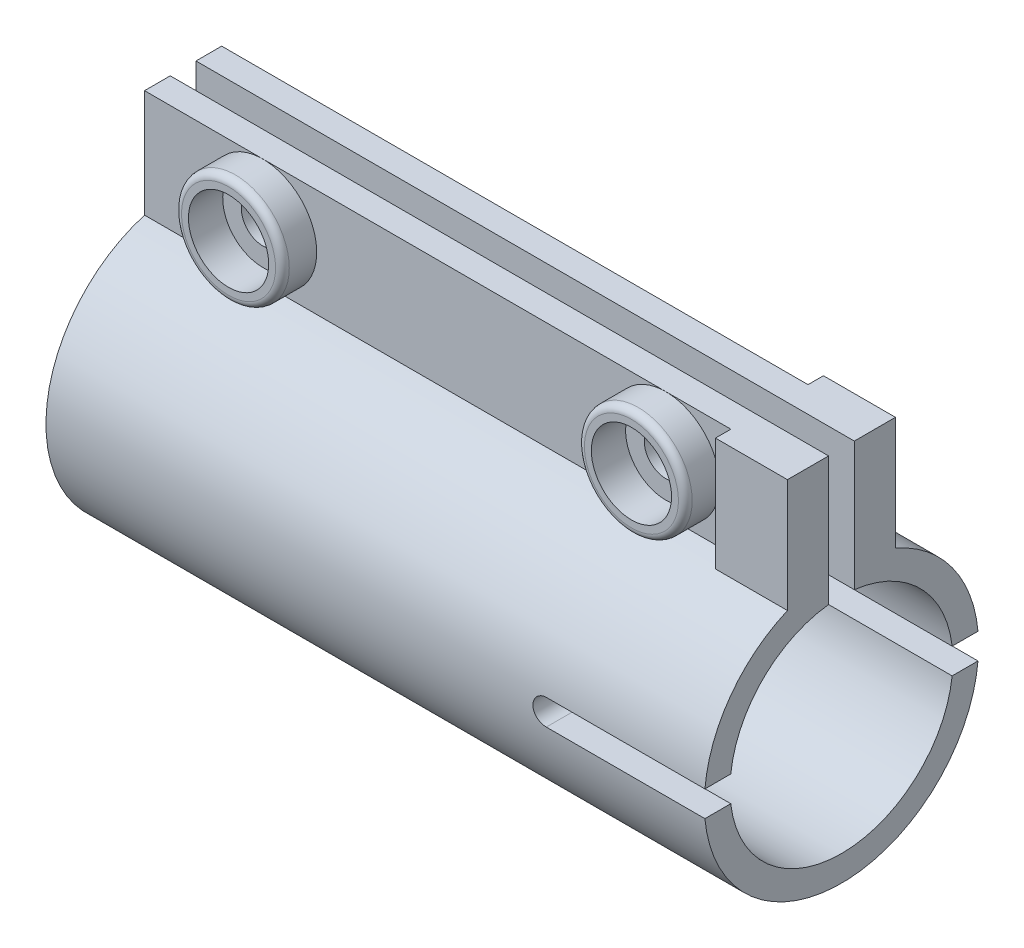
ISO-10303-21;
HEADER;
FILE_DESCRIPTION(('STEP AP214'),'2;1');
FILE_NAME('part.step','',(''),(''),'','','');
FILE_SCHEMA(('AUTOMOTIVE_DESIGN { 1 0 10303 214 1 1 1 1 }'));
ENDSEC;
DATA;
#1=APPLICATION_CONTEXT('core data for automotive mechanical design processes');
#2=APPLICATION_PROTOCOL_DEFINITION('international standard','automotive_design',2000,#1);
#3=PRODUCT_CONTEXT('',#1,'mechanical');
#4=PRODUCT('Part','Part','',(#3));
#5=PRODUCT_RELATED_PRODUCT_CATEGORY('part','',(#4));
#6=PRODUCT_DEFINITION_FORMATION('','',#4);
#7=PRODUCT_DEFINITION_CONTEXT('part definition',#1,'design');
#8=PRODUCT_DEFINITION('design','',#6,#7);
#9=PRODUCT_DEFINITION_SHAPE('','',#8);
#10=(LENGTH_UNIT() NAMED_UNIT(*) SI_UNIT(.MILLI.,.METRE.));
#11=(NAMED_UNIT(*) PLANE_ANGLE_UNIT() SI_UNIT($,.RADIAN.));
#12=(NAMED_UNIT(*) SI_UNIT($,.STERADIAN.) SOLID_ANGLE_UNIT());
#13=UNCERTAINTY_MEASURE_WITH_UNIT(LENGTH_MEASURE(1.E-05),#10,'distance_accuracy_value','');
#14=(GEOMETRIC_REPRESENTATION_CONTEXT(3) GLOBAL_UNCERTAINTY_ASSIGNED_CONTEXT((#13)) GLOBAL_UNIT_ASSIGNED_CONTEXT((#10,
#11,#12)) REPRESENTATION_CONTEXT('',''));
#15=CARTESIAN_POINT('',(0.,0.,0.));
#16=DIRECTION('',(0.,0.,1.));
#17=DIRECTION('',(1.,0.,0.));
#18=AXIS2_PLACEMENT_3D('',#15,#16,#17);
#19=CARTESIAN_POINT('',(-48.768,17.735253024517,2.8575));
#20=DIRECTION('',(0.,0.,1.));
#21=DIRECTION('',(0.,-1.,0.));
#22=AXIS2_PLACEMENT_3D('',#19,#20,#21);
#23=PLANE('',#22);
#24=DIRECTION('',(1.,0.,0.));
#25=VECTOR('',#24,1.);
#26=CARTESIAN_POINT('',(-48.768,9.74988685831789,2.8575));
#27=LINE('',#26,#25);
#28=CARTESIAN_POINT('',(-40.005,9.7498868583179,2.8575));
#29=VERTEX_POINT('',#28);
#30=CARTESIAN_POINT('',(-10.16,9.74988685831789,2.8575));
#31=VERTEX_POINT('',#30);
#32=EDGE_CURVE('E262',#29,#31,#27,.T.);
#33=ORIENTED_EDGE('',*,*,#32,.T.);
#34=CARTESIAN_POINT('',(-10.16,13.7414,2.8575));
#35=DIRECTION('',(0.,0.,1.));
#36=DIRECTION('',(1.,0.,0.));
#37=AXIS2_PLACEMENT_3D('',#34,#35,#36);
#38=CIRCLE('',#37,3.9915131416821);
#39=EDGE_CURVE('E42',#31,#31,#38,.T.);
#40=ORIENTED_EDGE('',*,*,#39,.F.);
#41=CARTESIAN_POINT('',(-5.334,9.74988685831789,2.8575));
#42=VERTEX_POINT('',#41);
#43=EDGE_CURVE('E255',#31,#42,#27,.T.);
#44=ORIENTED_EDGE('',*,*,#43,.T.);
#45=DIRECTION('',(0.,-1.,0.));
#46=VECTOR('',#45,1.);
#47=CARTESIAN_POINT('',(-5.334,17.735253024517,2.8575));
#48=LINE('',#47,#46);
#49=CARTESIAN_POINT('',(-5.334,17.735253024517,2.8575));
#50=VERTEX_POINT('',#49);
#51=EDGE_CURVE('E219',#50,#42,#48,.T.);
#52=ORIENTED_EDGE('',*,*,#51,.F.);
#53=DIRECTION('',(1.,0.,0.));
#54=VECTOR('',#53,1.);
#55=CARTESIAN_POINT('',(-48.768,17.735253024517,2.8575));
#56=LINE('',#55,#54);
#57=CARTESIAN_POINT('',(-48.768,17.735253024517,2.8575));
#58=VERTEX_POINT('',#57);
#59=EDGE_CURVE('E252',#58,#50,#56,.T.);
#60=ORIENTED_EDGE('',*,*,#59,.F.);
#61=DIRECTION('',(0.,-1.,0.));
#62=VECTOR('',#61,1.);
#63=CARTESIAN_POINT('',(-48.768,17.735253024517,2.8575));
#64=LINE('',#63,#62);
#65=CARTESIAN_POINT('',(-48.768,9.7498868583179,2.8575));
#66=VERTEX_POINT('',#65);
#67=EDGE_CURVE('E249',#58,#66,#64,.T.);
#68=ORIENTED_EDGE('',*,*,#67,.T.);
#69=EDGE_CURVE('E258',#66,#29,#27,.T.);
#70=ORIENTED_EDGE('',*,*,#69,.T.);
#71=CARTESIAN_POINT('',(-40.005,13.7414,2.8575));
#72=DIRECTION('',(0.,0.,1.));
#73=DIRECTION('',(1.,0.,0.));
#74=AXIS2_PLACEMENT_3D('',#71,#72,#73);
#75=CIRCLE('',#74,3.9915131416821);
#76=EDGE_CURVE('E47',#29,#29,#75,.T.);
#77=ORIENTED_EDGE('',*,*,#76,.F.);
#78=EDGE_LOOP('',(#33,#40,#44,#52,#60,#68,#70,#77));
#79=FACE_BOUND('',#78,.T.);
#80=ADVANCED_FACE('F28',(#79),#23,.T.);
#81=CARTESIAN_POINT('',(-10.16,13.7414,2.8575));
#82=DIRECTION('',(0.,0.,1.));
#83=DIRECTION('',(0.,-1.,0.));
#84=AXIS2_PLACEMENT_3D('',#81,#82,#83);
#85=CIRCLE('',#84,2.9718);
#86=CARTESIAN_POINT('',(-10.16,10.7696,2.8575));
#87=VERTEX_POINT('',#86);
#88=EDGE_CURVE('E585',#87,#87,#85,.F.);
#89=ORIENTED_EDGE('',*,*,#88,.F.);
#90=EDGE_LOOP('',(#89));
#91=FACE_BOUND('',#90,.T.);
#92=CARTESIAN_POINT('',(-10.16,13.7414,2.8575));
#93=DIRECTION('',(0.,0.,1.));
#94=DIRECTION('',(1.,0.,0.));
#95=AXIS2_PLACEMENT_3D('',#92,#93,#94);
#96=CIRCLE('',#95,1.5875);
#97=CARTESIAN_POINT('',(-8.57249999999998,13.7414,2.8575));
#98=VERTEX_POINT('',#97);
#99=EDGE_CURVE('E206',#98,#98,#96,.T.);
#100=ORIENTED_EDGE('',*,*,#99,.F.);
#101=EDGE_LOOP('',(#100));
#102=FACE_BOUND('',#101,.T.);
#103=ADVANCED_FACE('F354',(#91,#102),#23,.T.);
#104=CARTESIAN_POINT('',(-48.768,0.,0.));
#105=DIRECTION('',(1.,0.,0.));
#106=DIRECTION('',(0.,0.,-1.));
#107=AXIS2_PLACEMENT_3D('',#104,#105,#106);
#108=CYLINDRICAL_SURFACE('',#107,10.16);
#109=CARTESIAN_POINT('',(-5.334,0.,0.));
#110=DIRECTION('',(-1.,0.,0.));
#111=DIRECTION('',(0.,0.,1.));
#112=AXIS2_PLACEMENT_3D('',#109,#110,#111);
#113=CIRCLE('',#112,10.16);
#114=CARTESIAN_POINT('',(-5.334,9.33925049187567,-4.0005));
#115=VERTEX_POINT('',#114);
#116=CARTESIAN_POINT('',(-5.33400000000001,9.74988685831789,-2.8575));
#117=VERTEX_POINT('',#116);
#118=EDGE_CURVE('E193',#115,#117,#113,.F.);
#119=ORIENTED_EDGE('',*,*,#118,.F.);
#120=DIRECTION('',(1.,0.,0.));
#121=VECTOR('',#120,1.);
#122=CARTESIAN_POINT('',(-5.334,9.33925049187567,-4.0005));
#123=LINE('',#122,#121);
#124=CARTESIAN_POINT('',(0.,9.33925049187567,-4.0005));
#125=VERTEX_POINT('',#124);
#126=EDGE_CURVE('E194',#115,#125,#123,.T.);
#127=ORIENTED_EDGE('',*,*,#126,.T.);
#128=CARTESIAN_POINT('',(0.,0.,0.));
#129=DIRECTION('',(1.,0.,0.));
#130=DIRECTION('',(0.,0.,-1.));
#131=AXIS2_PLACEMENT_3D('',#128,#129,#130);
#132=CIRCLE('',#131,10.16);
#133=CARTESIAN_POINT('',(0.,0.9525,-10.115253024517));
#134=VERTEX_POINT('',#133);
#135=EDGE_CURVE('E200',#134,#125,#132,.T.);
#136=ORIENTED_EDGE('',*,*,#135,.F.);
#137=DIRECTION('',(1.,0.,0.));
#138=VECTOR('',#137,1.);
#139=CARTESIAN_POINT('',(-48.768,0.952500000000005,-10.115253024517));
#140=LINE('',#139,#138);
#141=CARTESIAN_POINT('',(-11.7475,0.952500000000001,-10.115253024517));
#142=VERTEX_POINT('',#141);
#143=EDGE_CURVE('E287',#142,#134,#140,.T.);
#144=ORIENTED_EDGE('',*,*,#143,.F.);
#145=CARTESIAN_POINT('',(-11.7475,-0.9525,-10.115253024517));
#146=CARTESIAN_POINT('',(-11.7742350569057,-0.952499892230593,-10.115252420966));
#147=CARTESIAN_POINT('',(-11.800957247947,-0.951373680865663,-10.1153591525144));
#148=CARTESIAN_POINT('',(-11.8542092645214,-0.946881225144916,-10.1157809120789));
#149=CARTESIAN_POINT('',(-11.8807391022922,-0.943515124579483,-10.1160959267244));
#150=CARTESIAN_POINT('',(-11.959701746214,-0.930090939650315,-10.1173423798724));
#151=CARTESIAN_POINT('',(-12.0116037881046,-0.916706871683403,-10.1185752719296));
#152=CARTESIAN_POINT('',(-12.1124099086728,-0.88144962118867,-10.1217071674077));
#153=CARTESIAN_POINT('',(-12.1613128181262,-0.859573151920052,-10.1236064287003));
#154=CARTESIAN_POINT('',(-12.2547539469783,-0.807958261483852,-10.1278562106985));
#155=CARTESIAN_POINT('',(-12.2992927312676,-0.778220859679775,-10.1302066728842));
#156=CARTESIAN_POINT('',(-12.3828762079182,-0.711629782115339,-10.1351022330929));
#157=CARTESIAN_POINT('',(-12.4219053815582,-0.67475667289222,-10.1376478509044));
#158=CARTESIAN_POINT('',(-12.4932356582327,-0.594977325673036,-10.1426424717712));
#159=CARTESIAN_POINT('',(-12.5255357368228,-0.55207017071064,-10.1450914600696));
#160=CARTESIAN_POINT('',(-12.5825387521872,-0.461347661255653,-10.1496217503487));
#161=CARTESIAN_POINT('',(-12.6072277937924,-0.413523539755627,-10.1517023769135));
#162=CARTESIAN_POINT('',(-12.6482178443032,-0.31438864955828,-10.1552556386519));
#163=CARTESIAN_POINT('',(-12.6645195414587,-0.263078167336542,-10.1567283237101));
#164=CARTESIAN_POINT('',(-12.688227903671,-0.158584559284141,-10.1588962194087));
#165=CARTESIAN_POINT('',(-12.6956605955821,-0.105407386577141,-10.1595937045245));
#166=CARTESIAN_POINT('',(-12.7015005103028,0.00144524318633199,-10.1601403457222));
#167=CARTESIAN_POINT('',(-12.6999077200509,0.0551207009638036,-10.1599895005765));
#168=CARTESIAN_POINT('',(-12.6877627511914,0.161266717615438,-10.1588583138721));
#169=CARTESIAN_POINT('',(-12.6772388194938,0.213740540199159,-10.1578805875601));
#170=CARTESIAN_POINT('',(-12.6475743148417,0.316173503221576,-10.155208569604));
#171=CARTESIAN_POINT('',(-12.6284336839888,0.366132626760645,-10.1535142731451));
#172=CARTESIAN_POINT('',(-12.5820475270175,0.462208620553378,-10.1495951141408));
#173=CARTESIAN_POINT('',(-12.5547892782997,0.50831931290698,-10.1473694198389));
#174=CARTESIAN_POINT('',(-12.4929520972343,0.595319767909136,-10.1426374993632));
#175=CARTESIAN_POINT('',(-12.4583733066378,0.636209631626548,-10.1401312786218));
#176=CARTESIAN_POINT('',(-12.3827231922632,0.711770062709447,-10.135108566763));
#177=CARTESIAN_POINT('',(-12.3416282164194,0.746416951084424,-10.1325920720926));
#178=CARTESIAN_POINT('',(-12.2541769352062,0.80833480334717,-10.1278409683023));
#179=CARTESIAN_POINT('',(-12.2078190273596,0.835603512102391,-10.1256064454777));
#180=CARTESIAN_POINT('',(-12.1111341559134,0.881989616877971,-10.1216717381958));
#181=CARTESIAN_POINT('',(-12.0608041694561,0.901100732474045,-10.1199719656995));
#182=CARTESIAN_POINT('',(-11.9576679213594,0.930565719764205,-10.1173054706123));
#183=CARTESIAN_POINT('',(-11.9048655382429,0.940932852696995,-10.1163376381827));
#184=CARTESIAN_POINT('',(-11.8343298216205,0.94869474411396,-10.1156106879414));
#185=CARTESIAN_POINT('',(-11.8169794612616,0.950122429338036,-10.115476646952));
#186=CARTESIAN_POINT('',(-11.782255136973,0.952023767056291,-10.1152979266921));
#187=CARTESIAN_POINT('',(-11.7648812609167,0.952499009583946,-10.1152530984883));
#188=CARTESIAN_POINT('',(-11.7475,0.952500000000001,-10.115253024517));
#189=B_SPLINE_CURVE_WITH_KNOTS('',3,(#145,#146,#147,#148,#149,#150,#151,#152,#153,#154,#155,
#156,#157,#158,#159,#160,#161,#162,#163,#164,#165,#166,#167,#168,#169,#170,#171,#172,#173,#174,
#175,#176,#177,#178,#179,#180,#181,#182,#183,#184,#185,#186,#187,#188),.UNSPECIFIED.,.F.,.F.,(4,
2,2,2,2,2,2,2,2,2,2,2,2,2,2,2,2,2,2,2,2,4),(0.,0.0801557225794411,0.160306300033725,
0.320322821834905,0.480401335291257,0.640459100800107,0.800959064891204,0.961483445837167,
1.1222991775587,1.28310171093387,1.44343118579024,1.6037608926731,1.76358539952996,
1.92341098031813,2.08348838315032,2.24356268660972,2.40423191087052,2.56495018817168,
2.72579197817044,2.88638939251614,2.93859909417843,2.99072156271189),.UNSPECIFIED.);
#190=CARTESIAN_POINT('',(-11.7475,-0.9525,-10.115253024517));
#191=VERTEX_POINT('',#190);
#192=EDGE_CURVE('E297',#191,#142,#189,.T.);
#193=ORIENTED_EDGE('',*,*,#192,.F.);
#194=DIRECTION('',(1.,0.,0.));
#195=VECTOR('',#194,1.);
#196=CARTESIAN_POINT('',(-48.768,-0.952499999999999,-10.115253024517));
#197=LINE('',#196,#195);
#198=CARTESIAN_POINT('',(0.,-0.9525,-10.115253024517));
#199=VERTEX_POINT('',#198);
#200=EDGE_CURVE('E609',#199,#191,#197,.F.);
#201=ORIENTED_EDGE('',*,*,#200,.F.);
#202=CARTESIAN_POINT('',(0.,-0.9525,10.115253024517));
#203=VERTEX_POINT('',#202);
#204=EDGE_CURVE('E619',#203,#199,#132,.T.);
#205=ORIENTED_EDGE('',*,*,#204,.F.);
#206=DIRECTION('',(1.,0.,0.));
#207=VECTOR('',#206,1.);
#208=CARTESIAN_POINT('',(-48.768,-0.952499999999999,10.115253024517));
#209=LINE('',#208,#207);
#210=CARTESIAN_POINT('',(-11.7475,-0.9525,10.115253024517));
#211=VERTEX_POINT('',#210);
#212=EDGE_CURVE('E612',#211,#203,#209,.T.);
#213=ORIENTED_EDGE('',*,*,#212,.F.);
#214=CARTESIAN_POINT('',(-11.7475,0.952500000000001,10.115253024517));
#215=CARTESIAN_POINT('',(-11.7742350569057,0.952499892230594,10.115252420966));
#216=CARTESIAN_POINT('',(-11.800957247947,0.951373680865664,10.1153591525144));
#217=CARTESIAN_POINT('',(-11.8542092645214,0.946881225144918,10.1157809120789));
#218=CARTESIAN_POINT('',(-11.8807391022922,0.943515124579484,10.1160959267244));
#219=CARTESIAN_POINT('',(-11.959701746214,0.930090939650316,10.1173423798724));
#220=CARTESIAN_POINT('',(-12.0116037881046,0.916706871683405,10.1185752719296));
#221=CARTESIAN_POINT('',(-12.1124099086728,0.881449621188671,10.1217071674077));
#222=CARTESIAN_POINT('',(-12.1613128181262,0.859573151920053,10.1236064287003));
#223=CARTESIAN_POINT('',(-12.2547539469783,0.807958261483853,10.1278562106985));
#224=CARTESIAN_POINT('',(-12.2992927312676,0.778220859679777,10.1302066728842));
#225=CARTESIAN_POINT('',(-12.3828762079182,0.71162978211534,10.1351022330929));
#226=CARTESIAN_POINT('',(-12.4219053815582,0.674756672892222,10.1376478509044));
#227=CARTESIAN_POINT('',(-12.4932356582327,0.594977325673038,10.1426424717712));
#228=CARTESIAN_POINT('',(-12.5255357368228,0.552070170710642,10.1450914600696));
#229=CARTESIAN_POINT('',(-12.5825387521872,0.461347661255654,10.1496217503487));
#230=CARTESIAN_POINT('',(-12.6072277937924,0.413523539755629,10.1517023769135));
#231=CARTESIAN_POINT('',(-12.6482178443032,0.314388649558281,10.1552556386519));
#232=CARTESIAN_POINT('',(-12.6645195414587,0.263078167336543,10.1567283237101));
#233=CARTESIAN_POINT('',(-12.688227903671,0.158584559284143,10.1588962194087));
#234=CARTESIAN_POINT('',(-12.6956605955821,0.105407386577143,10.1595937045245));
#235=CARTESIAN_POINT('',(-12.7015005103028,-0.00144524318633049,10.1601403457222));
#236=CARTESIAN_POINT('',(-12.6999077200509,-0.0551207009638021,10.1599895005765));
#237=CARTESIAN_POINT('',(-12.6877627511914,-0.161266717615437,10.1588583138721));
#238=CARTESIAN_POINT('',(-12.6772388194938,-0.213740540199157,10.1578805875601));
#239=CARTESIAN_POINT('',(-12.6475743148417,-0.316173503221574,10.155208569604));
#240=CARTESIAN_POINT('',(-12.6284336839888,-0.366132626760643,10.1535142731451));
#241=CARTESIAN_POINT('',(-12.5820475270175,-0.462208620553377,10.1495951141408));
#242=CARTESIAN_POINT('',(-12.5547892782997,-0.508319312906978,10.1473694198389));
#243=CARTESIAN_POINT('',(-12.4929520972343,-0.595319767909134,10.1426374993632));
#244=CARTESIAN_POINT('',(-12.4583733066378,-0.636209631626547,10.1401312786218));
#245=CARTESIAN_POINT('',(-12.3827231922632,-0.711770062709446,10.135108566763));
#246=CARTESIAN_POINT('',(-12.3416282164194,-0.746416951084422,10.1325920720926));
#247=CARTESIAN_POINT('',(-12.2541769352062,-0.808334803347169,10.1278409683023));
#248=CARTESIAN_POINT('',(-12.2078190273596,-0.83560351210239,10.1256064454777));
#249=CARTESIAN_POINT('',(-12.1111341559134,-0.88198961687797,10.1216717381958));
#250=CARTESIAN_POINT('',(-12.0608041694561,-0.901100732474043,10.1199719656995));
#251=CARTESIAN_POINT('',(-11.9576679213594,-0.930565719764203,10.1173054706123));
#252=CARTESIAN_POINT('',(-11.9048655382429,-0.940932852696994,10.1163376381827));
#253=CARTESIAN_POINT('',(-11.8343298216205,-0.948694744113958,10.1156106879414));
#254=CARTESIAN_POINT('',(-11.8169794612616,-0.950122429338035,10.115476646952));
#255=CARTESIAN_POINT('',(-11.782255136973,-0.95202376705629,10.1152979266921));
#256=CARTESIAN_POINT('',(-11.7648812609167,-0.952499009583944,10.1152530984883));
#257=CARTESIAN_POINT('',(-11.7475,-0.9525,10.115253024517));
#258=B_SPLINE_CURVE_WITH_KNOTS('',3,(#214,#215,#216,#217,#218,#219,#220,#221,#222,#223,#224,
#225,#226,#227,#228,#229,#230,#231,#232,#233,#234,#235,#236,#237,#238,#239,#240,#241,#242,#243,
#244,#245,#246,#247,#248,#249,#250,#251,#252,#253,#254,#255,#256,#257),.UNSPECIFIED.,.F.,.F.,(4,
2,2,2,2,2,2,2,2,2,2,2,2,2,2,2,2,2,2,2,2,4),(0.,0.0801557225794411,0.160306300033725,
0.320322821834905,0.480401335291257,0.640459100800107,0.800959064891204,0.961483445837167,
1.1222991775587,1.28310171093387,1.44343118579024,1.6037608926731,1.76358539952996,
1.92341098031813,2.08348838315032,2.24356268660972,2.40423191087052,2.56495018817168,
2.72579197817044,2.88638939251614,2.93859909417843,2.99072156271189),.UNSPECIFIED.);
#259=CARTESIAN_POINT('',(-11.7475,0.952500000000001,10.115253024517));
#260=VERTEX_POINT('',#259);
#261=EDGE_CURVE('E291',#260,#211,#258,.T.);
#262=ORIENTED_EDGE('',*,*,#261,.F.);
#263=DIRECTION('',(1.,0.,0.));
#264=VECTOR('',#263,1.);
#265=CARTESIAN_POINT('',(-48.768,0.952500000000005,10.115253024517));
#266=LINE('',#265,#264);
#267=CARTESIAN_POINT('',(0.,0.9525,10.115253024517));
#268=VERTEX_POINT('',#267);
#269=EDGE_CURVE('E289',#268,#260,#266,.F.);
#270=ORIENTED_EDGE('',*,*,#269,.F.);
#271=CARTESIAN_POINT('',(0.,9.33925049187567,4.0005));
#272=VERTEX_POINT('',#271);
#273=EDGE_CURVE('E620',#272,#268,#132,.T.);
#274=ORIENTED_EDGE('',*,*,#273,.F.);
#275=DIRECTION('',(1.,0.,0.));
#276=VECTOR('',#275,1.);
#277=CARTESIAN_POINT('',(-5.334,9.33925049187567,4.0005));
#278=LINE('',#277,#276);
#279=CARTESIAN_POINT('',(-5.334,9.33925049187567,4.0005));
#280=VERTEX_POINT('',#279);
#281=EDGE_CURVE('E230',#280,#272,#278,.T.);
#282=ORIENTED_EDGE('',*,*,#281,.F.);
#283=CARTESIAN_POINT('',(-5.334,0.,0.));
#284=DIRECTION('',(-1.,0.,0.));
#285=DIRECTION('',(0.,0.,1.));
#286=AXIS2_PLACEMENT_3D('',#283,#284,#285);
#287=CIRCLE('',#286,10.16);
#288=EDGE_CURVE('E184',#42,#280,#287,.F.);
#289=ORIENTED_EDGE('',*,*,#288,.F.);
#290=ORIENTED_EDGE('',*,*,#43,.F.);
#291=ORIENTED_EDGE('',*,*,#32,.F.);
#292=ORIENTED_EDGE('',*,*,#69,.F.);
#293=CARTESIAN_POINT('',(-48.768,0.,0.));
#294=DIRECTION('',(1.,0.,0.));
#295=DIRECTION('',(0.,0.,-1.));
#296=AXIS2_PLACEMENT_3D('',#293,#294,#295);
#297=CIRCLE('',#296,10.16);
#298=CARTESIAN_POINT('',(-48.768,9.7498868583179,-2.8575));
#299=VERTEX_POINT('',#298);
#300=EDGE_CURVE('E623',#66,#299,#297,.T.);
#301=ORIENTED_EDGE('',*,*,#300,.T.);
#302=DIRECTION('',(1.,0.,0.));
#303=VECTOR('',#302,1.);
#304=CARTESIAN_POINT('',(-48.768,9.74988685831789,-2.8575));
#305=LINE('',#304,#303);
#306=EDGE_CURVE('E240',#299,#117,#305,.T.);
#307=ORIENTED_EDGE('',*,*,#306,.T.);
#308=EDGE_LOOP('',(#119,#127,#136,#144,#193,#201,#205,#213,#262,#270,#274,#282,#289,#290,#291,
#292,#301,#307));
#309=FACE_BOUND('',#308,.T.);
#310=ADVANCED_FACE('F30',(#309),#108,.T.);
#311=CARTESIAN_POINT('',(0.,0.,0.));
#312=DIRECTION('',(1.,0.,0.));
#313=DIRECTION('',(0.,0.,-1.));
#314=AXIS2_PLACEMENT_3D('',#311,#312,#313);
#315=PLANE('',#314);
#316=ORIENTED_EDGE('',*,*,#135,.T.);
#317=DIRECTION('',(0.,1.,0.));
#318=VECTOR('',#317,1.);
#319=CARTESIAN_POINT('',(0.,9.33925049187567,-4.0005));
#320=LINE('',#319,#318);
#321=CARTESIAN_POINT('',(0.,17.735253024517,-4.0005));
#322=VERTEX_POINT('',#321);
#323=EDGE_CURVE('E190',#125,#322,#320,.T.);
#324=ORIENTED_EDGE('',*,*,#323,.T.);
#325=DIRECTION('',(0.,0.,1.));
#326=VECTOR('',#325,1.);
#327=CARTESIAN_POINT('',(0.,17.735253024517,-2.8575));
#328=LINE('',#327,#326);
#329=CARTESIAN_POINT('',(0.,17.735253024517,-0.9525));
#330=VERTEX_POINT('',#329);
#331=EDGE_CURVE('E171',#322,#330,#328,.T.);
#332=ORIENTED_EDGE('',*,*,#331,.T.);
#333=DIRECTION('',(0.,1.,0.));
#334=VECTOR('',#333,1.);
#335=CARTESIAN_POINT('',(0.,0.,-0.9525));
#336=LINE('',#335,#334);
#337=CARTESIAN_POINT('',(0.,8.19986394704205,-0.9525));
#338=VERTEX_POINT('',#337);
#339=EDGE_CURVE('E261',#338,#330,#336,.T.);
#340=ORIENTED_EDGE('',*,*,#339,.F.);
#341=CARTESIAN_POINT('',(0.,0.,0.));
#342=DIRECTION('',(1.,0.,0.));
#343=DIRECTION('',(0.,0.,-1.));
#344=AXIS2_PLACEMENT_3D('',#341,#342,#343);
#345=CIRCLE('',#344,8.255);
#346=CARTESIAN_POINT('',(0.,0.952500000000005,-8.19986394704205));
#347=VERTEX_POINT('',#346);
#348=EDGE_CURVE('E611',#347,#338,#345,.T.);
#349=ORIENTED_EDGE('',*,*,#348,.F.);
#350=DIRECTION('',(0.,0.,1.));
#351=VECTOR('',#350,1.);
#352=CARTESIAN_POINT('',(0.,0.9525,-10.16));
#353=LINE('',#352,#351);
#354=EDGE_CURVE('E274',#134,#347,#353,.T.);
#355=ORIENTED_EDGE('',*,*,#354,.F.);
#356=EDGE_LOOP('',(#316,#324,#332,#340,#349,#355));
#357=FACE_BOUND('',#356,.T.);
#358=ADVANCED_FACE('F197',(#357),#315,.T.);
#359=DIRECTION('',(0.,0.,1.));
#360=VECTOR('',#359,1.);
#361=CARTESIAN_POINT('',(0.,-0.9525,-10.16));
#362=LINE('',#361,#360);
#363=CARTESIAN_POINT('',(0.,-0.9525,8.19986394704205));
#364=VERTEX_POINT('',#363);
#365=EDGE_CURVE('E283',#364,#203,#362,.T.);
#366=ORIENTED_EDGE('',*,*,#365,.T.);
#367=ORIENTED_EDGE('',*,*,#204,.T.);
#368=CARTESIAN_POINT('',(0.,-0.9525,-8.19986394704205));
#369=VERTEX_POINT('',#368);
#370=EDGE_CURVE('E286',#199,#369,#362,.T.);
#371=ORIENTED_EDGE('',*,*,#370,.T.);
#372=EDGE_CURVE('E600',#364,#369,#345,.T.);
#373=ORIENTED_EDGE('',*,*,#372,.F.);
#374=EDGE_LOOP('',(#366,#367,#371,#373));
#375=FACE_BOUND('',#374,.T.);
#376=ADVANCED_FACE('F345',(#375),#315,.T.);
#377=CARTESIAN_POINT('',(-48.768,0.,0.));
#378=DIRECTION('',(1.,0.,0.));
#379=DIRECTION('',(0.,0.,-1.));
#380=AXIS2_PLACEMENT_3D('',#377,#378,#379);
#381=PLANE('',#380);
#382=DIRECTION('',(0.,1.,0.));
#383=VECTOR('',#382,1.);
#384=CARTESIAN_POINT('',(-48.768,0.,-0.9525));
#385=LINE('',#384,#383);
#386=CARTESIAN_POINT('',(-48.768,8.19986394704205,-0.9525));
#387=VERTEX_POINT('',#386);
#388=CARTESIAN_POINT('',(-48.768,17.735253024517,-0.9525));
#389=VERTEX_POINT('',#388);
#390=EDGE_CURVE('E266',#387,#389,#385,.T.);
#391=ORIENTED_EDGE('',*,*,#390,.T.);
#392=DIRECTION('',(0.,0.,1.));
#393=VECTOR('',#392,1.);
#394=CARTESIAN_POINT('',(-48.768,17.735253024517,-2.8575));
#395=LINE('',#394,#393);
#396=CARTESIAN_POINT('',(-48.768,17.735253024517,-2.8575));
#397=VERTEX_POINT('',#396);
#398=EDGE_CURVE('E183',#397,#389,#395,.T.);
#399=ORIENTED_EDGE('',*,*,#398,.F.);
#400=DIRECTION('',(0.,-1.,0.));
#401=VECTOR('',#400,1.);
#402=CARTESIAN_POINT('',(-48.768,17.735253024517,-2.8575));
#403=LINE('',#402,#401);
#404=EDGE_CURVE('E234',#397,#299,#403,.T.);
#405=ORIENTED_EDGE('',*,*,#404,.T.);
#406=ORIENTED_EDGE('',*,*,#300,.F.);
#407=ORIENTED_EDGE('',*,*,#67,.F.);
#408=DIRECTION('',(0.,0.,-1.));
#409=VECTOR('',#408,1.);
#410=CARTESIAN_POINT('',(-48.768,17.735253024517,2.8575));
#411=LINE('',#410,#409);
#412=CARTESIAN_POINT('',(-48.768,17.735253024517,0.952499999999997));
#413=VERTEX_POINT('',#412);
#414=EDGE_CURVE('E246',#58,#413,#411,.T.);
#415=ORIENTED_EDGE('',*,*,#414,.T.);
#416=DIRECTION('',(0.,-1.,0.));
#417=VECTOR('',#416,1.);
#418=CARTESIAN_POINT('',(-48.768,10.16,0.952499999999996));
#419=LINE('',#418,#417);
#420=CARTESIAN_POINT('',(-48.768,8.19986394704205,0.952499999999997));
#421=VERTEX_POINT('',#420);
#422=EDGE_CURVE('E268',#413,#421,#419,.T.);
#423=ORIENTED_EDGE('',*,*,#422,.T.);
#424=CARTESIAN_POINT('',(-48.768,0.,0.));
#425=DIRECTION('',(1.,0.,0.));
#426=DIRECTION('',(0.,0.,-1.));
#427=AXIS2_PLACEMENT_3D('',#424,#425,#426);
#428=CIRCLE('',#427,8.255);
#429=EDGE_CURVE('E615',#421,#387,#428,.T.);
#430=ORIENTED_EDGE('',*,*,#429,.T.);
#431=EDGE_LOOP('',(#391,#399,#405,#406,#407,#415,#423,#430));
#432=FACE_BOUND('',#431,.T.);
#433=ADVANCED_FACE('F343',(#432),#381,.F.);
#434=DIRECTION('',(0.,1.,0.));
#435=VECTOR('',#434,1.);
#436=CARTESIAN_POINT('',(0.,9.33925049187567,4.0005));
#437=LINE('',#436,#435);
#438=CARTESIAN_POINT('',(0.,17.735253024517,4.0005));
#439=VERTEX_POINT('',#438);
#440=EDGE_CURVE('E216',#272,#439,#437,.T.);
#441=ORIENTED_EDGE('',*,*,#440,.F.);
#442=ORIENTED_EDGE('',*,*,#273,.T.);
#443=CARTESIAN_POINT('',(0.,0.9525,8.19986394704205));
#444=VERTEX_POINT('',#443);
#445=EDGE_CURVE('E271',#444,#268,#353,.T.);
#446=ORIENTED_EDGE('',*,*,#445,.F.);
#447=CARTESIAN_POINT('',(0.,8.19986394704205,0.952499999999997));
#448=VERTEX_POINT('',#447);
#449=EDGE_CURVE('E608',#448,#444,#345,.T.);
#450=ORIENTED_EDGE('',*,*,#449,.F.);
#451=DIRECTION('',(0.,-1.,0.));
#452=VECTOR('',#451,1.);
#453=CARTESIAN_POINT('',(0.,10.16,0.952499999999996));
#454=LINE('',#453,#452);
#455=CARTESIAN_POINT('',(0.,17.735253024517,0.952499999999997));
#456=VERTEX_POINT('',#455);
#457=EDGE_CURVE('E264',#456,#448,#454,.T.);
#458=ORIENTED_EDGE('',*,*,#457,.F.);
#459=DIRECTION('',(0.,0.,-1.));
#460=VECTOR('',#459,1.);
#461=CARTESIAN_POINT('',(0.,17.735253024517,2.8575));
#462=LINE('',#461,#460);
#463=EDGE_CURVE('E243',#439,#456,#462,.T.);
#464=ORIENTED_EDGE('',*,*,#463,.F.);
#465=EDGE_LOOP('',(#441,#442,#446,#450,#458,#464));
#466=FACE_BOUND('',#465,.T.);
#467=ADVANCED_FACE('F339',(#466),#315,.T.);
#468=CARTESIAN_POINT('',(-48.768,0.,0.));
#469=DIRECTION('',(1.,0.,0.));
#470=DIRECTION('',(0.,0.,-1.));
#471=AXIS2_PLACEMENT_3D('',#468,#469,#470);
#472=CYLINDRICAL_SURFACE('',#471,8.255);
#473=ORIENTED_EDGE('',*,*,#348,.T.);
#474=DIRECTION('',(1.,0.,0.));
#475=VECTOR('',#474,1.);
#476=CARTESIAN_POINT('',(-48.768,8.19986394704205,-0.9525));
#477=LINE('',#476,#475);
#478=EDGE_CURVE('E589',#338,#387,#477,.F.);
#479=ORIENTED_EDGE('',*,*,#478,.T.);
#480=ORIENTED_EDGE('',*,*,#429,.F.);
#481=DIRECTION('',(1.,0.,0.));
#482=VECTOR('',#481,1.);
#483=CARTESIAN_POINT('',(-48.768,8.19986394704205,0.952499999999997));
#484=LINE('',#483,#482);
#485=EDGE_CURVE('E591',#421,#448,#484,.T.);
#486=ORIENTED_EDGE('',*,*,#485,.T.);
#487=ORIENTED_EDGE('',*,*,#449,.T.);
#488=DIRECTION('',(1.,0.,0.));
#489=VECTOR('',#488,1.);
#490=CARTESIAN_POINT('',(-48.768,0.952500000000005,8.19986394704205));
#491=LINE('',#490,#489);
#492=CARTESIAN_POINT('',(-11.7475,0.952500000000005,8.19986394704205));
#493=VERTEX_POINT('',#492);
#494=EDGE_CURVE('E333',#444,#493,#491,.F.);
#495=ORIENTED_EDGE('',*,*,#494,.T.);
#496=CARTESIAN_POINT('',(-11.7475,0.952500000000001,8.19986394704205));
#497=CARTESIAN_POINT('',(-11.7742027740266,0.952499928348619,8.19986319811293));
#498=CARTESIAN_POINT('',(-11.8008926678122,0.951376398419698,8.19999454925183));
#499=CARTESIAN_POINT('',(-11.8540797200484,0.946894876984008,8.20051355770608));
#500=CARTESIAN_POINT('',(-11.8805768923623,0.943537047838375,8.20090119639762));
#501=CARTESIAN_POINT('',(-11.9594364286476,0.930147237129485,8.20243482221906));
#502=CARTESIAN_POINT('',(-12.0112677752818,0.91679882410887,8.20395157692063));
#503=CARTESIAN_POINT('',(-12.1119333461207,0.881641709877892,8.20780371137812));
#504=CARTESIAN_POINT('',(-12.160766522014,0.859830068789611,8.21013937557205));
#505=CARTESIAN_POINT('',(-12.2540823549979,0.80837346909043,8.21536509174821));
#506=CARTESIAN_POINT('',(-12.2985654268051,0.778729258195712,8.21825509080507));
#507=CARTESIAN_POINT('',(-12.3821211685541,0.712301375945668,8.22427900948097));
#508=CARTESIAN_POINT('',(-12.4211704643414,0.675488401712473,8.22741389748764));
#509=CARTESIAN_POINT('',(-12.4925558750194,0.595826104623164,8.23356600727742));
#510=CARTESIAN_POINT('',(-12.5248909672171,0.552975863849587,8.23658321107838));
#511=CARTESIAN_POINT('',(-12.5820080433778,0.462310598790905,8.24216957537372));
#512=CARTESIAN_POINT('',(-12.6067687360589,0.414482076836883,8.24473746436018));
#513=CARTESIAN_POINT('',(-12.6478966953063,0.315314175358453,8.24912495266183));
#514=CARTESIAN_POINT('',(-12.6642647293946,0.263975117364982,8.25094462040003));
#515=CARTESIAN_POINT('',(-12.6880742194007,0.159483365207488,8.25362392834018));
#516=CARTESIAN_POINT('',(-12.6955550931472,0.106339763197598,8.25448780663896));
#517=CARTESIAN_POINT('',(-12.7015000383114,-0.000456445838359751,8.25517265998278));
#518=CARTESIAN_POINT('',(-12.6999641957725,-0.054109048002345,8.25499364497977));
#519=CARTESIAN_POINT('',(-12.6879507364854,-0.160129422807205,8.25361628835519));
#520=CARTESIAN_POINT('',(-12.6775157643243,-0.21250209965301,8.25242280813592));
#521=CARTESIAN_POINT('',(-12.6480668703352,-0.314747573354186,8.24915614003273));
#522=CARTESIAN_POINT('',(-12.6290528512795,-0.364620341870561,8.24708294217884));
#523=CARTESIAN_POINT('',(-12.5829392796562,-0.460584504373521,8.24228141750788));
#524=CARTESIAN_POINT('',(-12.5558209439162,-0.506666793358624,8.23955157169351));
#525=CARTESIAN_POINT('',(-12.4942833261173,-0.593640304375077,8.23374270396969));
#526=CARTESIAN_POINT('',(-12.4598640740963,-0.634531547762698,8.23066368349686));
#527=CARTESIAN_POINT('',(-12.3844678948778,-0.710209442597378,8.22448055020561));
#528=CARTESIAN_POINT('',(-12.3434547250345,-0.744959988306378,8.22137639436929));
#529=CARTESIAN_POINT('',(-12.2561427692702,-0.807099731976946,8.21550927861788));
#530=CARTESIAN_POINT('',(-12.2098424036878,-0.834486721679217,8.21274642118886));
#531=CARTESIAN_POINT('',(-12.1132338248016,-0.881122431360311,8.2078743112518));
#532=CARTESIAN_POINT('',(-12.0629219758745,-0.900363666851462,8.20576566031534));
#533=CARTESIAN_POINT('',(-11.959788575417,-0.930086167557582,8.20245037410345));
#534=CARTESIAN_POINT('',(-11.9069709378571,-0.940580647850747,8.20124237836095));
#535=CARTESIAN_POINT('',(-11.8360645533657,-0.948540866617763,8.20032296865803));
#536=CARTESIAN_POINT('',(-11.8183689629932,-0.950026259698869,8.20015095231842));
#537=CARTESIAN_POINT('',(-11.7829513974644,-0.952004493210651,8.19992157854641));
#538=CARTESIAN_POINT('',(-11.7652295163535,-0.952498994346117,8.19986402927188));
#539=CARTESIAN_POINT('',(-11.7475,-0.9525,8.19986394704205));
#540=B_SPLINE_CURVE_WITH_KNOTS('',3,(#496,#497,#498,#499,#500,#501,#502,#503,#504,#505,#506,
#507,#508,#509,#510,#511,#512,#513,#514,#515,#516,#517,#518,#519,#520,#521,#522,#523,#524,#525,
#526,#527,#528,#529,#530,#531,#532,#533,#534,#535,#536,#537,#538,#539),.UNSPECIFIED.,.F.,.F.,(4,
2,2,2,2,2,2,2,2,2,2,2,2,2,2,2,2,2,2,2,2,4),(0.,0.0800588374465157,0.160111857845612,
0.319918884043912,0.479781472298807,0.639628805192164,0.800143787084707,0.960683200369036,
1.1216698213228,1.28264171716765,1.44289694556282,1.6031506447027,1.76264069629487,
1.92213255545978,2.08199697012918,2.24186072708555,2.40263524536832,2.56345792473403,
2.7244280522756,2.88515453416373,2.93841016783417,2.99157647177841),.UNSPECIFIED.);
#541=CARTESIAN_POINT('',(-11.7475,-0.9525,8.19986394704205));
#542=VERTEX_POINT('',#541);
#543=EDGE_CURVE('E325',#493,#542,#540,.T.);
#544=ORIENTED_EDGE('',*,*,#543,.T.);
#545=DIRECTION('',(1.,0.,0.));
#546=VECTOR('',#545,1.);
#547=CARTESIAN_POINT('',(-48.768,-0.952499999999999,8.19986394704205));
#548=LINE('',#547,#546);
#549=EDGE_CURVE('E332',#542,#364,#548,.T.);
#550=ORIENTED_EDGE('',*,*,#549,.T.);
#551=ORIENTED_EDGE('',*,*,#372,.T.);
#552=DIRECTION('',(1.,0.,0.));
#553=VECTOR('',#552,1.);
#554=CARTESIAN_POINT('',(-48.768,-0.952499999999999,-8.19986394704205));
#555=LINE('',#554,#553);
#556=CARTESIAN_POINT('',(-11.7475,-0.9525,-8.19986394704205));
#557=VERTEX_POINT('',#556);
#558=EDGE_CURVE('E627',#369,#557,#555,.F.);
#559=ORIENTED_EDGE('',*,*,#558,.T.);
#560=CARTESIAN_POINT('',(-11.7475,-0.9525,-8.19986394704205));
#561=CARTESIAN_POINT('',(-11.7742027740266,-0.952499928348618,-8.19986319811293));
#562=CARTESIAN_POINT('',(-11.8008926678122,-0.951376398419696,-8.19999454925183));
#563=CARTESIAN_POINT('',(-11.8540797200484,-0.946894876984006,-8.20051355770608));
#564=CARTESIAN_POINT('',(-11.8805768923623,-0.943537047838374,-8.20090119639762));
#565=CARTESIAN_POINT('',(-11.9594364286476,-0.930147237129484,-8.20243482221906));
#566=CARTESIAN_POINT('',(-12.0112677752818,-0.916798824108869,-8.20395157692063));
#567=CARTESIAN_POINT('',(-12.1119333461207,-0.88164170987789,-8.20780371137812));
#568=CARTESIAN_POINT('',(-12.160766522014,-0.859830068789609,-8.21013937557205));
#569=CARTESIAN_POINT('',(-12.2540823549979,-0.808373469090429,-8.21536509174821));
#570=CARTESIAN_POINT('',(-12.2985654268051,-0.778729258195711,-8.21825509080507));
#571=CARTESIAN_POINT('',(-12.3821211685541,-0.712301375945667,-8.22427900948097));
#572=CARTESIAN_POINT('',(-12.4211704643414,-0.675488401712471,-8.22741389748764));
#573=CARTESIAN_POINT('',(-12.4925558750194,-0.595826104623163,-8.23356600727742));
#574=CARTESIAN_POINT('',(-12.5248909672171,-0.552975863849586,-8.23658321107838));
#575=CARTESIAN_POINT('',(-12.5820080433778,-0.462310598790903,-8.24216957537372));
#576=CARTESIAN_POINT('',(-12.6067687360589,-0.414482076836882,-8.24473746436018));
#577=CARTESIAN_POINT('',(-12.6478966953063,-0.315314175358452,-8.24912495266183));
#578=CARTESIAN_POINT('',(-12.6642647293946,-0.26397511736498,-8.25094462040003));
#579=CARTESIAN_POINT('',(-12.6880742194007,-0.159483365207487,-8.25362392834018));
#580=CARTESIAN_POINT('',(-12.6955550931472,-0.106339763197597,-8.25448780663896));
#581=CARTESIAN_POINT('',(-12.7015000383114,0.000456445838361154,-8.25517265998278));
#582=CARTESIAN_POINT('',(-12.6999641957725,0.0541090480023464,-8.25499364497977));
#583=CARTESIAN_POINT('',(-12.6879507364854,0.160129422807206,-8.25361628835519));
#584=CARTESIAN_POINT('',(-12.6775157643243,0.212502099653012,-8.25242280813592));
#585=CARTESIAN_POINT('',(-12.6480668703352,0.314747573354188,-8.24915614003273));
#586=CARTESIAN_POINT('',(-12.6290528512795,0.364620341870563,-8.24708294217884));
#587=CARTESIAN_POINT('',(-12.5829392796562,0.460584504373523,-8.24228141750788));
#588=CARTESIAN_POINT('',(-12.5558209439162,0.506666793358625,-8.23955157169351));
#589=CARTESIAN_POINT('',(-12.4942833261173,0.593640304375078,-8.23374270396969));
#590=CARTESIAN_POINT('',(-12.4598640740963,0.6345315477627,-8.23066368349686));
#591=CARTESIAN_POINT('',(-12.3844678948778,0.710209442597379,-8.22448055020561));
#592=CARTESIAN_POINT('',(-12.3434547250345,0.74495998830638,-8.22137639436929));
#593=CARTESIAN_POINT('',(-12.2561427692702,0.807099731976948,-8.21550927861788));
#594=CARTESIAN_POINT('',(-12.2098424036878,0.834486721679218,-8.21274642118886));
#595=CARTESIAN_POINT('',(-12.1132338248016,0.881122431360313,-8.2078743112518));
#596=CARTESIAN_POINT('',(-12.0629219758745,0.900363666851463,-8.20576566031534));
#597=CARTESIAN_POINT('',(-11.959788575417,0.930086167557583,-8.20245037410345));
#598=CARTESIAN_POINT('',(-11.9069709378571,0.940580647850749,-8.20124237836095));
#599=CARTESIAN_POINT('',(-11.8360645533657,0.948540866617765,-8.20032296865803));
#600=CARTESIAN_POINT('',(-11.8183689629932,0.95002625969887,-8.20015095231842));
#601=CARTESIAN_POINT('',(-11.7829513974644,0.952004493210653,-8.19992157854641));
#602=CARTESIAN_POINT('',(-11.7652295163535,0.952498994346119,-8.19986402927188));
#603=CARTESIAN_POINT('',(-11.7475,0.952500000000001,-8.19986394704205));
#604=B_SPLINE_CURVE_WITH_KNOTS('',3,(#560,#561,#562,#563,#564,#565,#566,#567,#568,#569,#570,
#571,#572,#573,#574,#575,#576,#577,#578,#579,#580,#581,#582,#583,#584,#585,#586,#587,#588,#589,
#590,#591,#592,#593,#594,#595,#596,#597,#598,#599,#600,#601,#602,#603),.UNSPECIFIED.,.F.,.F.,(4,
2,2,2,2,2,2,2,2,2,2,2,2,2,2,2,2,2,2,2,2,4),(0.,0.080058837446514,0.160111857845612,
0.319918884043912,0.479781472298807,0.639628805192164,0.800143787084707,0.960683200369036,
1.1216698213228,1.28264171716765,1.44289694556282,1.6031506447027,1.76264069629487,
1.92213255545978,2.08199697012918,2.24186072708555,2.40263524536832,2.56345792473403,
2.7244280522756,2.88515453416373,2.93841016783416,2.99157647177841),.UNSPECIFIED.);
#605=CARTESIAN_POINT('',(-11.7475,0.952500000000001,-8.19986394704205));
#606=VERTEX_POINT('',#605);
#607=EDGE_CURVE('E317',#557,#606,#604,.T.);
#608=ORIENTED_EDGE('',*,*,#607,.T.);
#609=DIRECTION('',(1.,0.,0.));
#610=VECTOR('',#609,1.);
#611=CARTESIAN_POINT('',(-48.768,0.952500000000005,-8.19986394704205));
#612=LINE('',#611,#610);
#613=EDGE_CURVE('E625',#606,#347,#612,.T.);
#614=ORIENTED_EDGE('',*,*,#613,.T.);
#615=EDGE_LOOP('',(#473,#479,#480,#486,#487,#495,#544,#550,#551,#559,#608,#614));
#616=FACE_BOUND('',#615,.T.);
#617=ADVANCED_FACE('F335',(#616),#472,.F.);
#618=CARTESIAN_POINT('',(0.,0.9525,-10.16));
#619=DIRECTION('',(0.,1.,0.));
#620=DIRECTION('',(-1.,0.,0.));
#621=AXIS2_PLACEMENT_3D('',#618,#619,#620);
#622=PLANE('',#621);
#623=ORIENTED_EDGE('',*,*,#143,.T.);
#624=ORIENTED_EDGE('',*,*,#354,.T.);
#625=ORIENTED_EDGE('',*,*,#613,.F.);
#626=DIRECTION('',(0.,0.,1.));
#627=VECTOR('',#626,1.);
#628=CARTESIAN_POINT('',(-11.7475,0.952500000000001,-10.16));
#629=LINE('',#628,#627);
#630=EDGE_CURVE('E278',#142,#606,#629,.T.);
#631=ORIENTED_EDGE('',*,*,#630,.F.);
#632=EDGE_LOOP('',(#623,#624,#625,#631));
#633=FACE_BOUND('',#632,.T.);
#634=ADVANCED_FACE('F308',(#633),#622,.F.);
#635=CARTESIAN_POINT('',(-11.7475,0.,-10.16));
#636=DIRECTION('',(0.,0.,1.));
#637=DIRECTION('',(1.,0.,0.));
#638=AXIS2_PLACEMENT_3D('',#635,#636,#637);
#639=CYLINDRICAL_SURFACE('',#638,0.9525);
#640=ORIENTED_EDGE('',*,*,#192,.T.);
#641=ORIENTED_EDGE('',*,*,#630,.T.);
#642=ORIENTED_EDGE('',*,*,#607,.F.);
#643=DIRECTION('',(0.,0.,1.));
#644=VECTOR('',#643,1.);
#645=CARTESIAN_POINT('',(-11.7475,-0.9525,-10.16));
#646=LINE('',#645,#644);
#647=EDGE_CURVE('E282',#191,#557,#646,.T.);
#648=ORIENTED_EDGE('',*,*,#647,.F.);
#649=EDGE_LOOP('',(#640,#641,#642,#648));
#650=FACE_BOUND('',#649,.T.);
#651=ADVANCED_FACE('F302',(#650),#639,.F.);
#652=CARTESIAN_POINT('',(-11.7475,-0.9525,-10.16));
#653=DIRECTION('',(0.,-1.,0.));
#654=DIRECTION('',(1.,0.,0.));
#655=AXIS2_PLACEMENT_3D('',#652,#653,#654);
#656=PLANE('',#655);
#657=ORIENTED_EDGE('',*,*,#200,.T.);
#658=ORIENTED_EDGE('',*,*,#647,.T.);
#659=ORIENTED_EDGE('',*,*,#558,.F.);
#660=ORIENTED_EDGE('',*,*,#370,.F.);
#661=EDGE_LOOP('',(#657,#658,#659,#660));
#662=FACE_BOUND('',#661,.T.);
#663=ADVANCED_FACE('F307',(#662),#656,.F.);
#664=ORIENTED_EDGE('',*,*,#212,.T.);
#665=ORIENTED_EDGE('',*,*,#365,.F.);
#666=ORIENTED_EDGE('',*,*,#549,.F.);
#667=EDGE_CURVE('E279',#542,#211,#646,.T.);
#668=ORIENTED_EDGE('',*,*,#667,.T.);
#669=EDGE_LOOP('',(#664,#665,#666,#668));
#670=FACE_BOUND('',#669,.T.);
#671=ADVANCED_FACE('F640',(#670),#656,.F.);
#672=ORIENTED_EDGE('',*,*,#261,.T.);
#673=ORIENTED_EDGE('',*,*,#667,.F.);
#674=ORIENTED_EDGE('',*,*,#543,.F.);
#675=EDGE_CURVE('E275',#493,#260,#629,.T.);
#676=ORIENTED_EDGE('',*,*,#675,.T.);
#677=EDGE_LOOP('',(#672,#673,#674,#676));
#678=FACE_BOUND('',#677,.T.);
#679=ADVANCED_FACE('F310',(#678),#639,.F.);
#680=ORIENTED_EDGE('',*,*,#269,.T.);
#681=ORIENTED_EDGE('',*,*,#675,.F.);
#682=ORIENTED_EDGE('',*,*,#494,.F.);
#683=ORIENTED_EDGE('',*,*,#445,.T.);
#684=EDGE_LOOP('',(#680,#681,#682,#683));
#685=FACE_BOUND('',#684,.T.);
#686=ADVANCED_FACE('F311',(#685),#622,.F.);
#687=CARTESIAN_POINT('',(-48.768,10.16,0.952499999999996));
#688=DIRECTION('',(0.,0.,1.));
#689=DIRECTION('',(0.,-1.,0.));
#690=AXIS2_PLACEMENT_3D('',#687,#688,#689);
#691=PLANE('',#690);
#692=CARTESIAN_POINT('',(-40.005,13.7414,0.952499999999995));
#693=DIRECTION('',(0.,0.,1.));
#694=DIRECTION('',(0.,-1.,0.));
#695=AXIS2_PLACEMENT_3D('',#692,#693,#694);
#696=CIRCLE('',#695,1.5875);
#697=CARTESIAN_POINT('',(-38.4175,13.7414,0.952499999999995));
#698=VERTEX_POINT('',#697);
#699=EDGE_CURVE('E387',#698,#698,#696,.F.);
#700=ORIENTED_EDGE('',*,*,#699,.F.);
#701=EDGE_LOOP('',(#700));
#702=FACE_BOUND('',#701,.T.);
#703=CARTESIAN_POINT('',(-10.16,13.7414,0.952499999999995));
#704=DIRECTION('',(0.,0.,1.));
#705=DIRECTION('',(0.,-1.,0.));
#706=AXIS2_PLACEMENT_3D('',#703,#704,#705);
#707=CIRCLE('',#706,1.5875);
#708=CARTESIAN_POINT('',(-8.57249999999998,13.7414,0.952499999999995));
#709=VERTEX_POINT('',#708);
#710=EDGE_CURVE('E202',#709,#709,#707,.F.);
#711=ORIENTED_EDGE('',*,*,#710,.F.);
#712=EDGE_LOOP('',(#711));
#713=FACE_BOUND('',#712,.T.);
#714=ORIENTED_EDGE('',*,*,#422,.F.);
#715=DIRECTION('',(1.,0.,0.));
#716=VECTOR('',#715,1.);
#717=CARTESIAN_POINT('',(-48.768,17.735253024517,0.952499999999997));
#718=LINE('',#717,#716);
#719=EDGE_CURVE('E251',#413,#456,#718,.T.);
#720=ORIENTED_EDGE('',*,*,#719,.T.);
#721=ORIENTED_EDGE('',*,*,#457,.T.);
#722=ORIENTED_EDGE('',*,*,#485,.F.);
#723=EDGE_LOOP('',(#714,#720,#721,#722));
#724=FACE_BOUND('',#723,.T.);
#725=ADVANCED_FACE('F377',(#702,#713,#724),#691,.F.);
#726=CARTESIAN_POINT('',(-48.768,0.,-0.9525));
#727=DIRECTION('',(0.,0.,-1.));
#728=DIRECTION('',(0.,1.,0.));
#729=AXIS2_PLACEMENT_3D('',#726,#727,#728);
#730=PLANE('',#729);
#731=CARTESIAN_POINT('',(-10.16,13.7414,-0.9525));
#732=DIRECTION('',(0.,0.,-1.));
#733=DIRECTION('',(0.,1.,0.));
#734=AXIS2_PLACEMENT_3D('',#731,#732,#733);
#735=CIRCLE('',#734,1.5875);
#736=CARTESIAN_POINT('',(-10.16,15.3289,-0.9525));
#737=VERTEX_POINT('',#736);
#738=EDGE_CURVE('E398',#737,#737,#735,.F.);
#739=ORIENTED_EDGE('',*,*,#738,.F.);
#740=EDGE_LOOP('',(#739));
#741=FACE_BOUND('',#740,.T.);
#742=CARTESIAN_POINT('',(-40.005,13.7414,-0.9525));
#743=DIRECTION('',(0.,0.,-1.));
#744=DIRECTION('',(0.,1.,0.));
#745=AXIS2_PLACEMENT_3D('',#742,#743,#744);
#746=CIRCLE('',#745,1.5875);
#747=CARTESIAN_POINT('',(-40.005,15.3289,-0.9525));
#748=VERTEX_POINT('',#747);
#749=EDGE_CURVE('E388',#748,#748,#746,.F.);
#750=ORIENTED_EDGE('',*,*,#749,.F.);
#751=EDGE_LOOP('',(#750));
#752=FACE_BOUND('',#751,.T.);
#753=ORIENTED_EDGE('',*,*,#339,.T.);
#754=DIRECTION('',(1.,0.,0.));
#755=VECTOR('',#754,1.);
#756=CARTESIAN_POINT('',(-48.768,17.735253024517,-0.9525));
#757=LINE('',#756,#755);
#758=EDGE_CURVE('E179',#389,#330,#757,.T.);
#759=ORIENTED_EDGE('',*,*,#758,.F.);
#760=ORIENTED_EDGE('',*,*,#390,.F.);
#761=ORIENTED_EDGE('',*,*,#478,.F.);
#762=EDGE_LOOP('',(#753,#759,#760,#761));
#763=FACE_BOUND('',#762,.T.);
#764=ADVANCED_FACE('F368',(#741,#752,#763),#730,.F.);
#765=CARTESIAN_POINT('',(-40.005,13.7414,2.8575));
#766=DIRECTION('',(0.,0.,1.));
#767=DIRECTION('',(0.,-1.,0.));
#768=AXIS2_PLACEMENT_3D('',#765,#766,#767);
#769=CIRCLE('',#768,2.9718);
#770=CARTESIAN_POINT('',(-40.005,10.7696,2.8575));
#771=VERTEX_POINT('',#770);
#772=EDGE_CURVE('E382',#771,#771,#769,.F.);
#773=ORIENTED_EDGE('',*,*,#772,.F.);
#774=EDGE_LOOP('',(#773));
#775=FACE_BOUND('',#774,.T.);
#776=CARTESIAN_POINT('',(-40.005,13.7414,2.8575));
#777=DIRECTION('',(0.,0.,1.));
#778=DIRECTION('',(1.,0.,0.));
#779=AXIS2_PLACEMENT_3D('',#776,#777,#778);
#780=CIRCLE('',#779,1.5875);
#781=CARTESIAN_POINT('',(-38.4175,13.7414,2.8575));
#782=VERTEX_POINT('',#781);
#783=EDGE_CURVE('E385',#782,#782,#780,.T.);
#784=ORIENTED_EDGE('',*,*,#783,.F.);
#785=EDGE_LOOP('',(#784));
#786=FACE_BOUND('',#785,.T.);
#787=ADVANCED_FACE('F357',(#775,#786),#23,.T.);
#788=CARTESIAN_POINT('',(-48.768,17.735253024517,2.8575));
#789=DIRECTION('',(0.,-1.,0.));
#790=DIRECTION('',(0.,0.,-1.));
#791=AXIS2_PLACEMENT_3D('',#788,#789,#790);
#792=PLANE('',#791);
#793=ORIENTED_EDGE('',*,*,#463,.T.);
#794=ORIENTED_EDGE('',*,*,#719,.F.);
#795=ORIENTED_EDGE('',*,*,#414,.F.);
#796=ORIENTED_EDGE('',*,*,#59,.T.);
#797=DIRECTION('',(0.,0.,1.));
#798=VECTOR('',#797,1.);
#799=CARTESIAN_POINT('',(-5.334,17.735253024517,2.8575));
#800=LINE('',#799,#798);
#801=CARTESIAN_POINT('',(-5.334,17.735253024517,4.0005));
#802=VERTEX_POINT('',#801);
#803=EDGE_CURVE('E224',#50,#802,#800,.T.);
#804=ORIENTED_EDGE('',*,*,#803,.T.);
#805=DIRECTION('',(1.,0.,0.));
#806=VECTOR('',#805,1.);
#807=CARTESIAN_POINT('',(-5.334,17.735253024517,4.0005));
#808=LINE('',#807,#806);
#809=EDGE_CURVE('E227',#802,#439,#808,.T.);
#810=ORIENTED_EDGE('',*,*,#809,.T.);
#811=EDGE_LOOP('',(#793,#794,#795,#796,#804,#810));
#812=FACE_BOUND('',#811,.T.);
#813=ADVANCED_FACE('F367',(#812),#792,.F.);
#814=CARTESIAN_POINT('',(-48.768,17.735253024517,-2.8575));
#815=DIRECTION('',(0.,1.,0.));
#816=DIRECTION('',(0.,0.,1.));
#817=AXIS2_PLACEMENT_3D('',#814,#815,#816);
#818=PLANE('',#817);
#819=ORIENTED_EDGE('',*,*,#331,.F.);
#820=DIRECTION('',(1.,0.,0.));
#821=VECTOR('',#820,1.);
#822=CARTESIAN_POINT('',(-5.334,17.735253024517,-4.0005));
#823=LINE('',#822,#821);
#824=CARTESIAN_POINT('',(-5.334,17.735253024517,-4.0005));
#825=VERTEX_POINT('',#824);
#826=EDGE_CURVE('E175',#825,#322,#823,.T.);
#827=ORIENTED_EDGE('',*,*,#826,.F.);
#828=DIRECTION('',(0.,0.,-1.));
#829=VECTOR('',#828,1.);
#830=CARTESIAN_POINT('',(-5.334,17.735253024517,-2.8575));
#831=LINE('',#830,#829);
#832=CARTESIAN_POINT('',(-5.33400000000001,17.735253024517,-2.8575));
#833=VERTEX_POINT('',#832);
#834=EDGE_CURVE('E211',#833,#825,#831,.T.);
#835=ORIENTED_EDGE('',*,*,#834,.F.);
#836=DIRECTION('',(1.,0.,0.));
#837=VECTOR('',#836,1.);
#838=CARTESIAN_POINT('',(-48.768,17.735253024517,-2.8575));
#839=LINE('',#838,#837);
#840=EDGE_CURVE('E237',#397,#833,#839,.T.);
#841=ORIENTED_EDGE('',*,*,#840,.F.);
#842=ORIENTED_EDGE('',*,*,#398,.T.);
#843=ORIENTED_EDGE('',*,*,#758,.T.);
#844=EDGE_LOOP('',(#819,#827,#835,#841,#842,#843));
#845=FACE_BOUND('',#844,.T.);
#846=ADVANCED_FACE('F173',(#845),#818,.T.);
#847=CARTESIAN_POINT('',(-48.768,17.735253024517,-2.8575));
#848=DIRECTION('',(0.,0.,1.));
#849=DIRECTION('',(0.,-1.,0.));
#850=AXIS2_PLACEMENT_3D('',#847,#848,#849);
#851=PLANE('',#850);
#852=CARTESIAN_POINT('',(-10.16,13.7414,-2.8575));
#853=DIRECTION('',(0.,0.,-1.));
#854=DIRECTION('',(0.,1.,0.));
#855=AXIS2_PLACEMENT_3D('',#852,#853,#854);
#856=CIRCLE('',#855,1.5875);
#857=CARTESIAN_POINT('',(-10.16,15.3289,-2.8575));
#858=VERTEX_POINT('',#857);
#859=EDGE_CURVE('E401',#858,#858,#856,.T.);
#860=ORIENTED_EDGE('',*,*,#859,.F.);
#861=EDGE_LOOP('',(#860));
#862=FACE_BOUND('',#861,.T.);
#863=CARTESIAN_POINT('',(-40.005,13.7414,-2.8575));
#864=DIRECTION('',(0.,0.,-1.));
#865=DIRECTION('',(0.,1.,0.));
#866=AXIS2_PLACEMENT_3D('',#863,#864,#865);
#867=CIRCLE('',#866,1.5875);
#868=CARTESIAN_POINT('',(-40.005,15.3289,-2.8575));
#869=VERTEX_POINT('',#868);
#870=EDGE_CURVE('E393',#869,#869,#867,.T.);
#871=ORIENTED_EDGE('',*,*,#870,.F.);
#872=EDGE_LOOP('',(#871));
#873=FACE_BOUND('',#872,.T.);
#874=ORIENTED_EDGE('',*,*,#840,.T.);
#875=DIRECTION('',(0.,-1.,0.));
#876=VECTOR('',#875,1.);
#877=CARTESIAN_POINT('',(-5.334,17.735253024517,-2.8575));
#878=LINE('',#877,#876);
#879=EDGE_CURVE('E201',#833,#117,#878,.T.);
#880=ORIENTED_EDGE('',*,*,#879,.T.);
#881=ORIENTED_EDGE('',*,*,#306,.F.);
#882=ORIENTED_EDGE('',*,*,#404,.F.);
#883=EDGE_LOOP('',(#874,#880,#881,#882));
#884=FACE_BOUND('',#883,.T.);
#885=ADVANCED_FACE('F468',(#862,#873,#884),#851,.F.);
#886=CARTESIAN_POINT('',(-5.334,9.33925049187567,4.0005));
#887=DIRECTION('',(0.,0.,-1.));
#888=DIRECTION('',(-1.,0.,0.));
#889=AXIS2_PLACEMENT_3D('',#886,#887,#888);
#890=PLANE('',#889);
#891=ORIENTED_EDGE('',*,*,#440,.T.);
#892=ORIENTED_EDGE('',*,*,#809,.F.);
#893=DIRECTION('',(0.,1.,0.));
#894=VECTOR('',#893,1.);
#895=CARTESIAN_POINT('',(-5.334,9.33925049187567,4.0005));
#896=LINE('',#895,#894);
#897=EDGE_CURVE('E222',#280,#802,#896,.T.);
#898=ORIENTED_EDGE('',*,*,#897,.F.);
#899=ORIENTED_EDGE('',*,*,#281,.T.);
#900=EDGE_LOOP('',(#891,#892,#898,#899));
#901=FACE_BOUND('',#900,.T.);
#902=ADVANCED_FACE('F464',(#901),#890,.F.);
#903=CARTESIAN_POINT('',(-5.334,17.735253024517,2.8575));
#904=DIRECTION('',(-1.,0.,0.));
#905=DIRECTION('',(0.,0.,1.));
#906=AXIS2_PLACEMENT_3D('',#903,#904,#905);
#907=PLANE('',#906);
#908=ORIENTED_EDGE('',*,*,#51,.T.);
#909=ORIENTED_EDGE('',*,*,#288,.T.);
#910=ORIENTED_EDGE('',*,*,#897,.T.);
#911=ORIENTED_EDGE('',*,*,#803,.F.);
#912=EDGE_LOOP('',(#908,#909,#910,#911));
#913=FACE_BOUND('',#912,.T.);
#914=ADVANCED_FACE('F461',(#913),#907,.T.);
#915=CARTESIAN_POINT('',(-5.334,9.33925049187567,-4.0005));
#916=DIRECTION('',(0.,0.,-1.));
#917=DIRECTION('',(-1.,0.,0.));
#918=AXIS2_PLACEMENT_3D('',#915,#916,#917);
#919=PLANE('',#918);
#920=ORIENTED_EDGE('',*,*,#323,.F.);
#921=ORIENTED_EDGE('',*,*,#126,.F.);
#922=DIRECTION('',(0.,1.,0.));
#923=VECTOR('',#922,1.);
#924=CARTESIAN_POINT('',(-5.334,9.33925049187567,-4.0005));
#925=LINE('',#924,#923);
#926=EDGE_CURVE('E192',#115,#825,#925,.T.);
#927=ORIENTED_EDGE('',*,*,#926,.T.);
#928=ORIENTED_EDGE('',*,*,#826,.T.);
#929=EDGE_LOOP('',(#920,#921,#927,#928));
#930=FACE_BOUND('',#929,.T.);
#931=ADVANCED_FACE('F188',(#930),#919,.T.);
#932=CARTESIAN_POINT('',(-5.334,9.33925049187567,-2.8575));
#933=DIRECTION('',(-1.,0.,0.));
#934=DIRECTION('',(0.,0.,1.));
#935=AXIS2_PLACEMENT_3D('',#932,#933,#934);
#936=PLANE('',#935);
#937=ORIENTED_EDGE('',*,*,#926,.F.);
#938=ORIENTED_EDGE('',*,*,#118,.T.);
#939=ORIENTED_EDGE('',*,*,#879,.F.);
#940=ORIENTED_EDGE('',*,*,#834,.T.);
#941=EDGE_LOOP('',(#937,#938,#939,#940));
#942=FACE_BOUND('',#941,.T.);
#943=ADVANCED_FACE('F454',(#942),#936,.T.);
#944=CARTESIAN_POINT('',(-10.16,13.7414,-10.161));
#945=DIRECTION('',(0.,0.,1.));
#946=DIRECTION('',(1.,0.,0.));
#947=AXIS2_PLACEMENT_3D('',#944,#945,#946);
#948=CYLINDRICAL_SURFACE('',#947,1.5875);
#949=CARTESIAN_POINT('',(-8.57249999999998,13.7414,2.8575));
#950=CARTESIAN_POINT('',(-8.57249999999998,13.7414,2.83765625));
#951=CARTESIAN_POINT('',(-8.57249999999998,13.7414,2.8178125));
#952=CARTESIAN_POINT('',(-8.57249999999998,13.7414,2.778125));
#953=CARTESIAN_POINT('',(-8.57249999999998,13.7414,2.75828125));
#954=CARTESIAN_POINT('',(-8.57249999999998,13.7414,2.71859375));
#955=CARTESIAN_POINT('',(-8.57249999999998,13.7414,2.69875));
#956=CARTESIAN_POINT('',(-8.57249999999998,13.7414,2.65906249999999));
#957=CARTESIAN_POINT('',(-8.57249999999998,13.7414,2.63921875));
#958=CARTESIAN_POINT('',(-8.57249999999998,13.7414,2.59953125));
#959=CARTESIAN_POINT('',(-8.57249999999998,13.7414,2.5796875));
#960=CARTESIAN_POINT('',(-8.57249999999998,13.7414,2.54));
#961=CARTESIAN_POINT('',(-8.57249999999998,13.7414,2.52015625));
#962=CARTESIAN_POINT('',(-8.57249999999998,13.7414,2.48046875));
#963=CARTESIAN_POINT('',(-8.57249999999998,13.7414,2.460625));
#964=CARTESIAN_POINT('',(-8.57249999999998,13.7414,2.4209375));
#965=CARTESIAN_POINT('',(-8.57249999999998,13.7414,2.40109374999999));
#966=CARTESIAN_POINT('',(-8.57249999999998,13.7414,2.36140624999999));
#967=CARTESIAN_POINT('',(-8.57249999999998,13.7414,2.34156249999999));
#968=CARTESIAN_POINT('',(-8.57249999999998,13.7414,2.301875));
#969=CARTESIAN_POINT('',(-8.57249999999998,13.7414,2.28203124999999));
#970=CARTESIAN_POINT('',(-8.57249999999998,13.7414,2.24234375));
#971=CARTESIAN_POINT('',(-8.57249999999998,13.7414,2.2225));
#972=CARTESIAN_POINT('',(-8.57249999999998,13.7414,2.1828125));
#973=CARTESIAN_POINT('',(-8.57249999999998,13.7414,2.16296875));
#974=CARTESIAN_POINT('',(-8.57249999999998,13.7414,2.12328125));
#975=CARTESIAN_POINT('',(-8.57249999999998,13.7414,2.1034375));
#976=CARTESIAN_POINT('',(-8.57249999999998,13.7414,2.06375));
#977=CARTESIAN_POINT('',(-8.57249999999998,13.7414,2.04390625));
#978=CARTESIAN_POINT('',(-8.57249999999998,13.7414,2.00421874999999));
#979=CARTESIAN_POINT('',(-8.57249999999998,13.7414,1.98437499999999));
#980=CARTESIAN_POINT('',(-8.57249999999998,13.7414,1.9446875));
#981=CARTESIAN_POINT('',(-8.57249999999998,13.7414,1.92484375));
#982=CARTESIAN_POINT('',(-8.57249999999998,13.7414,1.88515625));
#983=CARTESIAN_POINT('',(-8.57249999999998,13.7414,1.8653125));
#984=CARTESIAN_POINT('',(-8.57249999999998,13.7414,1.825625));
#985=CARTESIAN_POINT('',(-8.57249999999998,13.7414,1.80578125));
#986=CARTESIAN_POINT('',(-8.57249999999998,13.7414,1.76609375));
#987=CARTESIAN_POINT('',(-8.57249999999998,13.7414,1.74625));
#988=CARTESIAN_POINT('',(-8.57249999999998,13.7414,1.7065625));
#989=CARTESIAN_POINT('',(-8.57249999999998,13.7414,1.68671875));
#990=CARTESIAN_POINT('',(-8.57249999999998,13.7414,1.64703124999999));
#991=CARTESIAN_POINT('',(-8.57249999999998,13.7414,1.62718749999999));
#992=CARTESIAN_POINT('',(-8.57249999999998,13.7414,1.5875));
#993=CARTESIAN_POINT('',(-8.57249999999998,13.7414,1.56765625));
#994=CARTESIAN_POINT('',(-8.57249999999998,13.7414,1.52796875));
#995=CARTESIAN_POINT('',(-8.57249999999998,13.7414,1.508125));
#996=CARTESIAN_POINT('',(-8.57249999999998,13.7414,1.4684375));
#997=CARTESIAN_POINT('',(-8.57249999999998,13.7414,1.44859375));
#998=CARTESIAN_POINT('',(-8.57249999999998,13.7414,1.40890625));
#999=CARTESIAN_POINT('',(-8.57249999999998,13.7414,1.3890625));
#1000=CARTESIAN_POINT('',(-8.57249999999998,13.7414,1.34937499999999));
#1001=CARTESIAN_POINT('',(-8.57249999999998,13.7414,1.32953124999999));
#1002=CARTESIAN_POINT('',(-8.57249999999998,13.7414,1.28984375));
#1003=CARTESIAN_POINT('',(-8.57249999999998,13.7414,1.27));
#1004=CARTESIAN_POINT('',(-8.57249999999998,13.7414,1.2303125));
#1005=CARTESIAN_POINT('',(-8.57249999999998,13.7414,1.21046875));
#1006=CARTESIAN_POINT('',(-8.57249999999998,13.7414,1.17078125));
#1007=CARTESIAN_POINT('',(-8.57249999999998,13.7414,1.1509375));
#1008=CARTESIAN_POINT('',(-8.57249999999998,13.7414,1.11125));
#1009=CARTESIAN_POINT('',(-8.57249999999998,13.7414,1.09140625));
#1010=CARTESIAN_POINT('',(-8.57249999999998,13.7414,1.05171874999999));
#1011=CARTESIAN_POINT('',(-8.57249999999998,13.7414,1.03187499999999));
#1012=CARTESIAN_POINT('',(-8.57249999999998,13.7414,0.992187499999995));
#1013=CARTESIAN_POINT('',(-8.57249999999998,13.7414,0.972343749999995));
#1014=CARTESIAN_POINT('',(-8.57249999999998,13.7414,0.952499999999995));
#1015=B_SPLINE_CURVE_WITH_KNOTS('',3,(#949,#950,#951,#952,#953,#954,#955,#956,#957,#958,#959,
#960,#961,#962,#963,#964,#965,#966,#967,#968,#969,#970,#971,#972,#973,#974,#975,#976,#977,#978,
#979,#980,#981,#982,#983,#984,#985,#986,#987,#988,#989,#990,#991,#992,#993,#994,#995,#996,#997,
#998,#999,#1000,#1001,#1002,#1003,#1004,#1005,#1006,#1007,#1008,#1009,#1010,#1011,#1012,#1013,
#1014),.UNSPECIFIED.,.F.,.F.,(4,2,2,2,2,2,2,2,2,2,2,2,2,2,2,2,2,2,2,2,2,2,2,2,2,2,2,2,2,2,2,2,
4),(0.,0.0595312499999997,0.119062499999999,0.178593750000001,0.238125,0.29765625,0.3571875,
0.41671875,0.476250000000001,0.535781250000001,0.5953125,0.65484375,0.714375,0.773906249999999,
0.833437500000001,0.892968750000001,0.9525,1.01203125,1.0715625,1.13109375,1.190625,1.25015625,
1.3096875,1.36921875,1.42875,1.48828125,1.5478125,1.60734375,1.666875,1.72640625,1.7859375,
1.84546875,1.905),.UNSPECIFIED.);
#1016=EDGE_CURVE('BSEAM451',#98,#709,#1015,.T.);
#1017=ORIENTED_EDGE('',*,*,#99,.T.);
#1018=ORIENTED_EDGE('',*,*,#710,.T.);
#1019=ORIENTED_EDGE('',*,*,#1016,.T.);
#1020=ORIENTED_EDGE('',*,*,#1016,.F.);
#1021=EDGE_LOOP('',(#1017,#1019,#1018,#1020));
#1022=FACE_BOUND('',#1021,.T.);
#1023=ADVANCED_FACE('F451',(#1022),#948,.F.);
#1024=CARTESIAN_POINT('',(-40.005,13.7414,-10.161));
#1025=DIRECTION('',(0.,0.,1.));
#1026=DIRECTION('',(1.,0.,0.));
#1027=AXIS2_PLACEMENT_3D('',#1024,#1025,#1026);
#1028=CYLINDRICAL_SURFACE('',#1027,1.5875);
#1029=CARTESIAN_POINT('',(-38.4175,13.7414,2.8575));
#1030=CARTESIAN_POINT('',(-38.4175,13.7414,2.83765625));
#1031=CARTESIAN_POINT('',(-38.4175,13.7414,2.8178125));
#1032=CARTESIAN_POINT('',(-38.4175,13.7414,2.778125));
#1033=CARTESIAN_POINT('',(-38.4175,13.7414,2.75828125));
#1034=CARTESIAN_POINT('',(-38.4175,13.7414,2.71859375));
#1035=CARTESIAN_POINT('',(-38.4175,13.7414,2.69875));
#1036=CARTESIAN_POINT('',(-38.4175,13.7414,2.65906249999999));
#1037=CARTESIAN_POINT('',(-38.4175,13.7414,2.63921875));
#1038=CARTESIAN_POINT('',(-38.4175,13.7414,2.59953125));
#1039=CARTESIAN_POINT('',(-38.4175,13.7414,2.5796875));
#1040=CARTESIAN_POINT('',(-38.4175,13.7414,2.54));
#1041=CARTESIAN_POINT('',(-38.4175,13.7414,2.52015625));
#1042=CARTESIAN_POINT('',(-38.4175,13.7414,2.48046875));
#1043=CARTESIAN_POINT('',(-38.4175,13.7414,2.460625));
#1044=CARTESIAN_POINT('',(-38.4175,13.7414,2.4209375));
#1045=CARTESIAN_POINT('',(-38.4175,13.7414,2.40109374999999));
#1046=CARTESIAN_POINT('',(-38.4175,13.7414,2.36140624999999));
#1047=CARTESIAN_POINT('',(-38.4175,13.7414,2.34156249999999));
#1048=CARTESIAN_POINT('',(-38.4175,13.7414,2.301875));
#1049=CARTESIAN_POINT('',(-38.4175,13.7414,2.28203124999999));
#1050=CARTESIAN_POINT('',(-38.4175,13.7414,2.24234375));
#1051=CARTESIAN_POINT('',(-38.4175,13.7414,2.2225));
#1052=CARTESIAN_POINT('',(-38.4175,13.7414,2.1828125));
#1053=CARTESIAN_POINT('',(-38.4175,13.7414,2.16296875));
#1054=CARTESIAN_POINT('',(-38.4175,13.7414,2.12328125));
#1055=CARTESIAN_POINT('',(-38.4175,13.7414,2.1034375));
#1056=CARTESIAN_POINT('',(-38.4175,13.7414,2.06375));
#1057=CARTESIAN_POINT('',(-38.4175,13.7414,2.04390625));
#1058=CARTESIAN_POINT('',(-38.4175,13.7414,2.00421874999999));
#1059=CARTESIAN_POINT('',(-38.4175,13.7414,1.98437499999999));
#1060=CARTESIAN_POINT('',(-38.4175,13.7414,1.9446875));
#1061=CARTESIAN_POINT('',(-38.4175,13.7414,1.92484375));
#1062=CARTESIAN_POINT('',(-38.4175,13.7414,1.88515625));
#1063=CARTESIAN_POINT('',(-38.4175,13.7414,1.8653125));
#1064=CARTESIAN_POINT('',(-38.4175,13.7414,1.825625));
#1065=CARTESIAN_POINT('',(-38.4175,13.7414,1.80578125));
#1066=CARTESIAN_POINT('',(-38.4175,13.7414,1.76609375));
#1067=CARTESIAN_POINT('',(-38.4175,13.7414,1.74625));
#1068=CARTESIAN_POINT('',(-38.4175,13.7414,1.7065625));
#1069=CARTESIAN_POINT('',(-38.4175,13.7414,1.68671875));
#1070=CARTESIAN_POINT('',(-38.4175,13.7414,1.64703124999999));
#1071=CARTESIAN_POINT('',(-38.4175,13.7414,1.62718749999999));
#1072=CARTESIAN_POINT('',(-38.4175,13.7414,1.5875));
#1073=CARTESIAN_POINT('',(-38.4175,13.7414,1.56765625));
#1074=CARTESIAN_POINT('',(-38.4175,13.7414,1.52796875));
#1075=CARTESIAN_POINT('',(-38.4175,13.7414,1.508125));
#1076=CARTESIAN_POINT('',(-38.4175,13.7414,1.4684375));
#1077=CARTESIAN_POINT('',(-38.4175,13.7414,1.44859375));
#1078=CARTESIAN_POINT('',(-38.4175,13.7414,1.40890625));
#1079=CARTESIAN_POINT('',(-38.4175,13.7414,1.3890625));
#1080=CARTESIAN_POINT('',(-38.4175,13.7414,1.34937499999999));
#1081=CARTESIAN_POINT('',(-38.4175,13.7414,1.32953124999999));
#1082=CARTESIAN_POINT('',(-38.4175,13.7414,1.28984375));
#1083=CARTESIAN_POINT('',(-38.4175,13.7414,1.27));
#1084=CARTESIAN_POINT('',(-38.4175,13.7414,1.2303125));
#1085=CARTESIAN_POINT('',(-38.4175,13.7414,1.21046875));
#1086=CARTESIAN_POINT('',(-38.4175,13.7414,1.17078125));
#1087=CARTESIAN_POINT('',(-38.4175,13.7414,1.1509375));
#1088=CARTESIAN_POINT('',(-38.4175,13.7414,1.11125));
#1089=CARTESIAN_POINT('',(-38.4175,13.7414,1.09140625));
#1090=CARTESIAN_POINT('',(-38.4175,13.7414,1.05171874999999));
#1091=CARTESIAN_POINT('',(-38.4175,13.7414,1.03187499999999));
#1092=CARTESIAN_POINT('',(-38.4175,13.7414,0.992187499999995));
#1093=CARTESIAN_POINT('',(-38.4175,13.7414,0.972343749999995));
#1094=CARTESIAN_POINT('',(-38.4175,13.7414,0.952499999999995));
#1095=B_SPLINE_CURVE_WITH_KNOTS('',3,(#1029,#1030,#1031,#1032,#1033,#1034,#1035,#1036,#1037,
#1038,#1039,#1040,#1041,#1042,#1043,#1044,#1045,#1046,#1047,#1048,#1049,#1050,#1051,#1052,#1053,
#1054,#1055,#1056,#1057,#1058,#1059,#1060,#1061,#1062,#1063,#1064,#1065,#1066,#1067,#1068,#1069,
#1070,#1071,#1072,#1073,#1074,#1075,#1076,#1077,#1078,#1079,#1080,#1081,#1082,#1083,#1084,#1085,
#1086,#1087,#1088,#1089,#1090,#1091,#1092,#1093,#1094),.UNSPECIFIED.,.F.,.F.,(4,2,2,2,2,2,2,2,2,
2,2,2,2,2,2,2,2,2,2,2,2,2,2,2,2,2,2,2,2,2,2,2,4),(0.,0.0595312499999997,0.119062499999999,
0.178593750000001,0.238125,0.29765625,0.3571875,0.41671875,0.476250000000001,0.535781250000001,
0.5953125,0.65484375,0.714375,0.773906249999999,0.833437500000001,0.892968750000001,0.9525,
1.01203125,1.0715625,1.13109375,1.190625,1.25015625,1.3096875,1.36921875,1.42875,1.48828125,
1.5478125,1.60734375,1.666875,1.72640625,1.7859375,1.84546875,1.905),.UNSPECIFIED.);
#1096=EDGE_CURVE('BSEAM447',#782,#698,#1095,.T.);
#1097=ORIENTED_EDGE('',*,*,#783,.T.);
#1098=ORIENTED_EDGE('',*,*,#699,.T.);
#1099=ORIENTED_EDGE('',*,*,#1096,.T.);
#1100=ORIENTED_EDGE('',*,*,#1096,.F.);
#1101=EDGE_LOOP('',(#1097,#1099,#1098,#1100));
#1102=FACE_BOUND('',#1101,.T.);
#1103=ADVANCED_FACE('F447',(#1102),#1028,.F.);
#1104=CARTESIAN_POINT('',(-40.005,13.7414,10.161));
#1105=DIRECTION('',(0.,0.,-1.));
#1106=DIRECTION('',(0.,1.,0.));
#1107=AXIS2_PLACEMENT_3D('',#1104,#1105,#1106);
#1108=CYLINDRICAL_SURFACE('',#1107,1.5875);
#1109=ORIENTED_EDGE('',*,*,#870,.T.);
#1110=EDGE_LOOP('',(#1109));
#1111=FACE_BOUND('',#1110,.T.);
#1112=ORIENTED_EDGE('',*,*,#749,.T.);
#1113=EDGE_LOOP('',(#1112));
#1114=FACE_BOUND('',#1113,.T.);
#1115=ADVANCED_FACE('F443',(#1111,#1114),#1108,.F.);
#1116=CARTESIAN_POINT('',(-10.16,13.7414,10.161));
#1117=DIRECTION('',(0.,0.,-1.));
#1118=DIRECTION('',(0.,1.,0.));
#1119=AXIS2_PLACEMENT_3D('',#1116,#1117,#1118);
#1120=CYLINDRICAL_SURFACE('',#1119,1.5875);
#1121=ORIENTED_EDGE('',*,*,#859,.T.);
#1122=EDGE_LOOP('',(#1121));
#1123=FACE_BOUND('',#1122,.T.);
#1124=ORIENTED_EDGE('',*,*,#738,.T.);
#1125=EDGE_LOOP('',(#1124));
#1126=FACE_BOUND('',#1125,.T.);
#1127=ADVANCED_FACE('F438',(#1123,#1126),#1120,.F.);
#1128=CARTESIAN_POINT('',(-40.005,13.7414,5.3975));
#1129=DIRECTION('',(0.,0.,1.));
#1130=DIRECTION('',(1.,0.,0.));
#1131=AXIS2_PLACEMENT_3D('',#1128,#1129,#1130);
#1132=PLANE('',#1131);
#1133=CARTESIAN_POINT('',(-40.005,13.7414,5.3975));
#1134=DIRECTION('',(0.,0.,1.));
#1135=DIRECTION('',(1.,0.,0.));
#1136=AXIS2_PLACEMENT_3D('',#1133,#1134,#1135);
#1137=CIRCLE('',#1136,3.4835131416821);
#1138=CARTESIAN_POINT('',(-36.5214868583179,13.7414,5.3975));
#1139=VERTEX_POINT('',#1138);
#1140=EDGE_CURVE('E580',#1139,#1139,#1137,.T.);
#1141=ORIENTED_EDGE('',*,*,#1140,.T.);
#1142=EDGE_LOOP('',(#1141));
#1143=FACE_BOUND('',#1142,.T.);
#1144=CARTESIAN_POINT('',(-40.005,13.7414,5.3975));
#1145=DIRECTION('',(0.,0.,1.));
#1146=DIRECTION('',(1.,0.,0.));
#1147=AXIS2_PLACEMENT_3D('',#1144,#1145,#1146);
#1148=CIRCLE('',#1147,2.9718);
#1149=CARTESIAN_POINT('',(-37.0332,13.7414,5.3975));
#1150=VERTEX_POINT('',#1149);
#1151=EDGE_CURVE('E405',#1150,#1150,#1148,.T.);
#1152=ORIENTED_EDGE('',*,*,#1151,.F.);
#1153=EDGE_LOOP('',(#1152));
#1154=FACE_BOUND('',#1153,.T.);
#1155=ADVANCED_FACE('F435',(#1143,#1154),#1132,.T.);
#1156=CARTESIAN_POINT('',(-40.005,13.7414,5.3975));
#1157=DIRECTION('',(0.,0.,-1.));
#1158=DIRECTION('',(-1.,0.,0.));
#1159=AXIS2_PLACEMENT_3D('',#1156,#1157,#1158);
#1160=CYLINDRICAL_SURFACE('',#1159,3.9915131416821);
#1161=CARTESIAN_POINT('',(-40.005,13.7414,4.8895));
#1162=DIRECTION('',(0.,0.,1.));
#1163=DIRECTION('',(1.,0.,0.));
#1164=AXIS2_PLACEMENT_3D('',#1161,#1162,#1163);
#1165=CIRCLE('',#1164,3.9915131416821);
#1166=CARTESIAN_POINT('',(-36.0134868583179,13.7414,4.8895));
#1167=VERTEX_POINT('',#1166);
#1168=EDGE_CURVE('E578',#1167,#1167,#1165,.F.);
#1169=ORIENTED_EDGE('',*,*,#1168,.T.);
#1170=EDGE_LOOP('',(#1169));
#1171=FACE_BOUND('',#1170,.T.);
#1172=ORIENTED_EDGE('',*,*,#76,.T.);
#1173=EDGE_LOOP('',(#1172));
#1174=FACE_BOUND('',#1173,.T.);
#1175=ADVANCED_FACE('F428',(#1171,#1174),#1160,.T.);
#1176=CARTESIAN_POINT('',(-40.005,13.7414,5.3975));
#1177=DIRECTION('',(0.,0.,-1.));
#1178=DIRECTION('',(-1.,0.,0.));
#1179=AXIS2_PLACEMENT_3D('',#1176,#1177,#1178);
#1180=CYLINDRICAL_SURFACE('',#1179,2.9718);
#1181=ORIENTED_EDGE('',*,*,#1151,.T.);
#1182=EDGE_LOOP('',(#1181));
#1183=FACE_BOUND('',#1182,.T.);
#1184=ORIENTED_EDGE('',*,*,#772,.T.);
#1185=EDGE_LOOP('',(#1184));
#1186=FACE_BOUND('',#1185,.T.);
#1187=ADVANCED_FACE('F419',(#1183,#1186),#1180,.F.);
#1188=CARTESIAN_POINT('',(-10.16,13.7414,5.3975));
#1189=DIRECTION('',(0.,0.,1.));
#1190=DIRECTION('',(1.,0.,0.));
#1191=AXIS2_PLACEMENT_3D('',#1188,#1189,#1190);
#1192=PLANE('',#1191);
#1193=CARTESIAN_POINT('',(-10.16,13.7414,5.3975));
#1194=DIRECTION('',(0.,0.,1.));
#1195=DIRECTION('',(1.,0.,0.));
#1196=AXIS2_PLACEMENT_3D('',#1193,#1194,#1195);
#1197=CIRCLE('',#1196,3.4835131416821);
#1198=CARTESIAN_POINT('',(-6.67648685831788,13.7414,5.3975));
#1199=VERTEX_POINT('',#1198);
#1200=EDGE_CURVE('E37',#1199,#1199,#1197,.T.);
#1201=ORIENTED_EDGE('',*,*,#1200,.T.);
#1202=EDGE_LOOP('',(#1201));
#1203=FACE_BOUND('',#1202,.T.);
#1204=CARTESIAN_POINT('',(-10.16,13.7414,5.3975));
#1205=DIRECTION('',(0.,0.,1.));
#1206=DIRECTION('',(1.,0.,0.));
#1207=AXIS2_PLACEMENT_3D('',#1204,#1205,#1206);
#1208=CIRCLE('',#1207,2.9718);
#1209=CARTESIAN_POINT('',(-7.18819999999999,13.7414,5.3975));
#1210=VERTEX_POINT('',#1209);
#1211=EDGE_CURVE('E409',#1210,#1210,#1208,.T.);
#1212=ORIENTED_EDGE('',*,*,#1211,.F.);
#1213=EDGE_LOOP('',(#1212));
#1214=FACE_BOUND('',#1213,.T.);
#1215=ADVANCED_FACE('F416',(#1203,#1214),#1192,.T.);
#1216=CARTESIAN_POINT('',(-10.16,13.7414,5.3975));
#1217=DIRECTION('',(0.,0.,-1.));
#1218=DIRECTION('',(-1.,0.,0.));
#1219=AXIS2_PLACEMENT_3D('',#1216,#1217,#1218);
#1220=CYLINDRICAL_SURFACE('',#1219,3.9915131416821);
#1221=CARTESIAN_POINT('',(-10.16,13.7414,4.8895));
#1222=DIRECTION('',(0.,0.,1.));
#1223=DIRECTION('',(1.,0.,0.));
#1224=AXIS2_PLACEMENT_3D('',#1221,#1222,#1223);
#1225=CIRCLE('',#1224,3.9915131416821);
#1226=CARTESIAN_POINT('',(-6.16848685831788,13.7414,4.8895));
#1227=VERTEX_POINT('',#1226);
#1228=EDGE_CURVE('E11',#1227,#1227,#1225,.F.);
#1229=ORIENTED_EDGE('',*,*,#1228,.T.);
#1230=EDGE_LOOP('',(#1229));
#1231=FACE_BOUND('',#1230,.T.);
#1232=ORIENTED_EDGE('',*,*,#39,.T.);
#1233=EDGE_LOOP('',(#1232));
#1234=FACE_BOUND('',#1233,.T.);
#1235=ADVANCED_FACE('F418',(#1231,#1234),#1220,.T.);
#1236=CARTESIAN_POINT('',(-10.16,13.7414,5.3975));
#1237=DIRECTION('',(0.,0.,-1.));
#1238=DIRECTION('',(-1.,0.,0.));
#1239=AXIS2_PLACEMENT_3D('',#1236,#1237,#1238);
#1240=CYLINDRICAL_SURFACE('',#1239,2.9718);
#1241=ORIENTED_EDGE('',*,*,#1211,.T.);
#1242=EDGE_LOOP('',(#1241));
#1243=FACE_BOUND('',#1242,.T.);
#1244=ORIENTED_EDGE('',*,*,#88,.T.);
#1245=EDGE_LOOP('',(#1244));
#1246=FACE_BOUND('',#1245,.T.);
#1247=ADVANCED_FACE('F413',(#1243,#1246),#1240,.F.);
#1248=CARTESIAN_POINT('',(-40.005,13.7414,4.8895));
#1249=DIRECTION('',(0.,0.,1.));
#1250=DIRECTION('',(1.,0.,0.));
#1251=AXIS2_PLACEMENT_3D('',#1248,#1249,#1250);
#1252=TOROIDAL_SURFACE('',#1251,3.4835131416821,0.508);
#1253=ORIENTED_EDGE('',*,*,#1168,.F.);
#1254=EDGE_LOOP('',(#1253));
#1255=FACE_BOUND('',#1254,.T.);
#1256=ORIENTED_EDGE('',*,*,#1140,.F.);
#1257=EDGE_LOOP('',(#1256));
#1258=FACE_BOUND('',#1257,.T.);
#1259=ADVANCED_FACE('F561',(#1255,#1258),#1252,.T.);
#1260=CARTESIAN_POINT('',(-10.16,13.7414,4.8895));
#1261=DIRECTION('',(0.,0.,1.));
#1262=DIRECTION('',(1.,0.,0.));
#1263=AXIS2_PLACEMENT_3D('',#1260,#1261,#1262);
#1264=TOROIDAL_SURFACE('',#1263,3.4835131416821,0.508);
#1265=ORIENTED_EDGE('',*,*,#1228,.F.);
#1266=EDGE_LOOP('',(#1265));
#1267=FACE_BOUND('',#1266,.T.);
#1268=ORIENTED_EDGE('',*,*,#1200,.F.);
#1269=EDGE_LOOP('',(#1268));
#1270=FACE_BOUND('',#1269,.T.);
#1271=ADVANCED_FACE('F566',(#1267,#1270),#1264,.T.);
#1272=CLOSED_SHELL('',(#80,#103,#310,#358,#376,#433,#467,#617,#634,#651,#663,#671,#679,#686,
#725,#764,#787,#813,#846,#885,#902,#914,#931,#943,#1023,#1103,#1115,#1127,#1155,#1175,#1187,
#1215,#1235,#1247,#1259,#1271));
#1273=MANIFOLD_SOLID_BREP('B2',#1272);
#1274=ADVANCED_BREP_SHAPE_REPRESENTATION('',(#18,#1273),#14);
#1275=SHAPE_DEFINITION_REPRESENTATION(#9,#1274);
ENDSEC;
END-ISO-10303-21;
